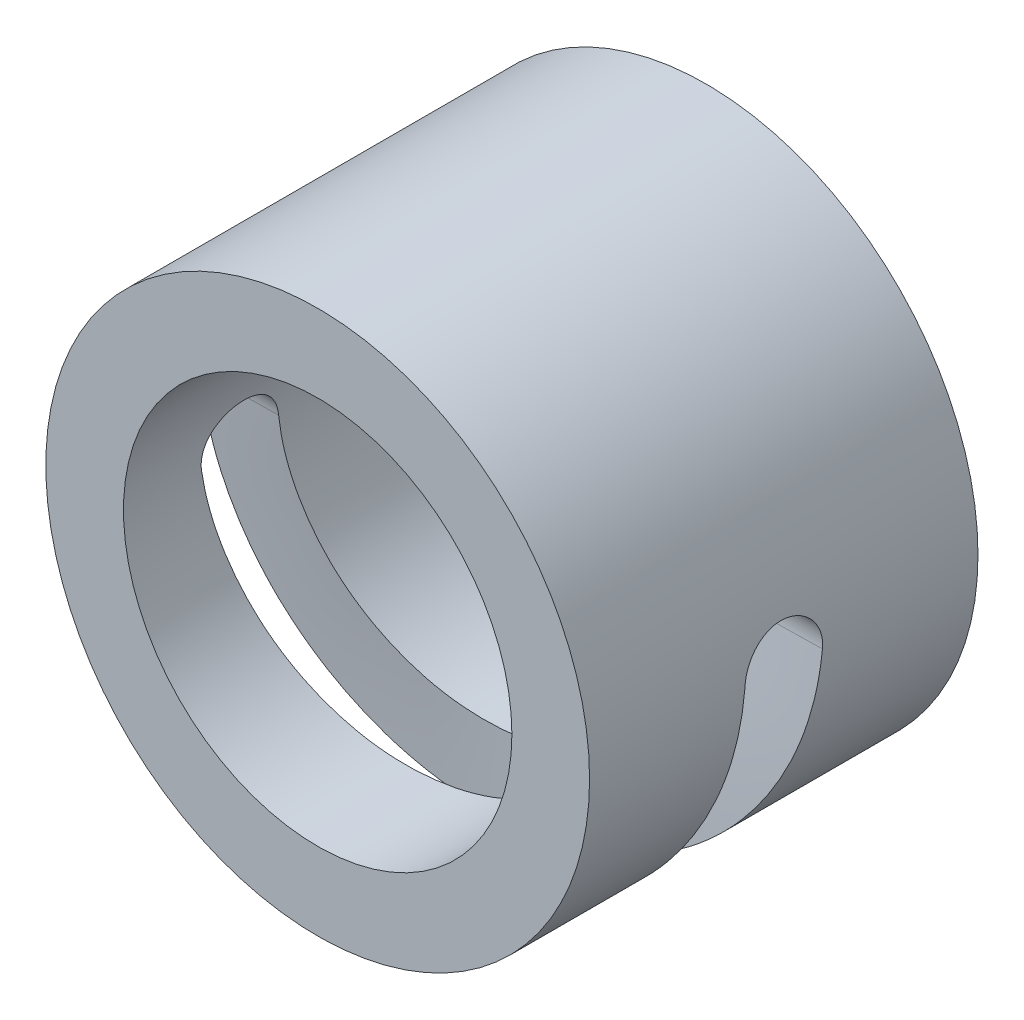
ISO-10303-21;
HEADER;
FILE_DESCRIPTION(('STEP AP214'),'2;1');
FILE_NAME('part.step','',(''),(''),'','','');
FILE_SCHEMA(('AUTOMOTIVE_DESIGN { 1 0 10303 214 1 1 1 1 }'));
ENDSEC;
DATA;
#1=APPLICATION_CONTEXT('core data for automotive mechanical design processes');
#2=APPLICATION_PROTOCOL_DEFINITION('international standard','automotive_design',2000,#1);
#3=PRODUCT_CONTEXT('',#1,'mechanical');
#4=PRODUCT('Part','Part','',(#3));
#5=PRODUCT_RELATED_PRODUCT_CATEGORY('part','',(#4));
#6=PRODUCT_DEFINITION_FORMATION('','',#4);
#7=PRODUCT_DEFINITION_CONTEXT('part definition',#1,'design');
#8=PRODUCT_DEFINITION('design','',#6,#7);
#9=PRODUCT_DEFINITION_SHAPE('','',#8);
#10=(LENGTH_UNIT() NAMED_UNIT(*) SI_UNIT(.MILLI.,.METRE.));
#11=(NAMED_UNIT(*) PLANE_ANGLE_UNIT() SI_UNIT($,.RADIAN.));
#12=(NAMED_UNIT(*) SI_UNIT($,.STERADIAN.) SOLID_ANGLE_UNIT());
#13=UNCERTAINTY_MEASURE_WITH_UNIT(LENGTH_MEASURE(1.E-05),#10,'distance_accuracy_value','');
#14=(GEOMETRIC_REPRESENTATION_CONTEXT(3) GLOBAL_UNCERTAINTY_ASSIGNED_CONTEXT((#13)) GLOBAL_UNIT_ASSIGNED_CONTEXT((#10,
#11,#12)) REPRESENTATION_CONTEXT('',''));
#15=CARTESIAN_POINT('',(0.,0.,0.));
#16=DIRECTION('',(0.,0.,1.));
#17=DIRECTION('',(1.,0.,0.));
#18=AXIS2_PLACEMENT_3D('',#15,#16,#17);
#19=CARTESIAN_POINT('',(0.,0.,50.));
#20=DIRECTION('',(0.,0.,-1.));
#21=DIRECTION('',(-1.,0.,0.));
#22=AXIS2_PLACEMENT_3D('',#19,#20,#21);
#23=CYLINDRICAL_SURFACE('',#22,70.);
#24=CARTESIAN_POINT('',(0.,0.,-50.));
#25=DIRECTION('',(0.,0.,1.));
#26=DIRECTION('',(1.,0.,0.));
#27=AXIS2_PLACEMENT_3D('',#24,#25,#26);
#28=CIRCLE('',#27,70.);
#29=CARTESIAN_POINT('',(70.,0.,-50.));
#30=VERTEX_POINT('',#29);
#31=EDGE_CURVE('E181',#30,#30,#28,.T.);
#32=ORIENTED_EDGE('',*,*,#31,.T.);
#33=EDGE_LOOP('',(#32));
#34=FACE_BOUND('',#33,.T.);
#35=CARTESIAN_POINT('',(0.,0.,50.));
#36=DIRECTION('',(0.,0.,1.));
#37=DIRECTION('',(1.,0.,0.));
#38=AXIS2_PLACEMENT_3D('',#35,#36,#37);
#39=CIRCLE('',#38,70.);
#40=CARTESIAN_POINT('',(70.,0.,50.));
#41=VERTEX_POINT('',#40);
#42=EDGE_CURVE('E183',#41,#41,#39,.T.);
#43=ORIENTED_EDGE('',*,*,#42,.F.);
#44=EDGE_LOOP('',(#43));
#45=FACE_BOUND('',#44,.T.);
#46=CARTESIAN_POINT('',(-69.9947983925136,0.853345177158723,10.036425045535));
#47=CARTESIAN_POINT('',(-69.9946719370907,0.863718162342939,10.0373134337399));
#48=CARTESIAN_POINT('',(-69.9945431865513,0.874089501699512,10.0382180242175));
#49=CARTESIAN_POINT('',(-69.9916487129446,1.10314258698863,10.0585568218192));
#50=CARTESIAN_POINT('',(-69.9878658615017,1.32124380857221,10.085186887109));
#51=CARTESIAN_POINT('',(-69.9783250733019,1.75534445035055,10.1527610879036));
#52=CARTESIAN_POINT('',(-69.9725652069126,1.97134160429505,10.1937192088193));
#53=CARTESIAN_POINT('',(-69.9573912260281,2.45703305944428,10.3025125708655));
#54=CARTESIAN_POINT('',(-69.947413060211,2.7257722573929,10.3745953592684));
#55=CARTESIAN_POINT('',(-69.9247238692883,3.2563102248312,10.5408877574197));
#56=CARTESIAN_POINT('',(-69.9120115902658,3.51810574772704,10.635107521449));
#57=CARTESIAN_POINT('',(-69.8841894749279,4.03319666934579,10.8451212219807));
#58=CARTESIAN_POINT('',(-69.8690763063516,4.28647965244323,10.960945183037));
#59=CARTESIAN_POINT('',(-69.8368833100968,4.78241485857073,11.213251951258));
#60=CARTESIAN_POINT('',(-69.8198034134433,5.02506670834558,11.3497354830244));
#61=CARTESIAN_POINT('',(-69.7840422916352,5.49948869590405,11.6432709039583));
#62=CARTESIAN_POINT('',(-69.7653520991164,5.73118506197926,11.8004409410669));
#63=CARTESIAN_POINT('',(-69.7269799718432,6.18054417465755,12.1336074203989));
#64=CARTESIAN_POINT('',(-69.7072980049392,6.39820646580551,12.3096044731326));
#65=CARTESIAN_POINT('',(-69.6674980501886,6.81792854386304,12.6791373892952));
#66=CARTESIAN_POINT('',(-69.6473802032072,7.01999327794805,12.8726676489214));
#67=CARTESIAN_POINT('',(-69.6072641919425,7.40720376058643,13.2759757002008));
#68=CARTESIAN_POINT('',(-69.5872660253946,7.59234983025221,13.4857531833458));
#69=CARTESIAN_POINT('',(-69.5477975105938,7.94579989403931,13.9217886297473));
#70=CARTESIAN_POINT('',(-69.528332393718,8.11396366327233,14.1481607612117));
#71=CARTESIAN_POINT('',(-69.49064709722,8.43062280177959,14.6143682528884));
#72=CARTESIAN_POINT('',(-69.4724269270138,8.57911802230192,14.8542037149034));
#73=CARTESIAN_POINT('',(-69.4377540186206,8.85537738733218,15.3456705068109));
#74=CARTESIAN_POINT('',(-69.4213013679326,8.98314050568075,15.5973024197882));
#75=CARTESIAN_POINT('',(-69.3906404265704,9.2169917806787,16.1105760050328));
#76=CARTESIAN_POINT('',(-69.3764321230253,9.32308006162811,16.3722176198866));
#77=CARTESIAN_POINT('',(-69.3507162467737,9.51247953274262,16.902770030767));
#78=CARTESIAN_POINT('',(-69.3391998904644,9.59586495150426,17.171653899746));
#79=CARTESIAN_POINT('',(-69.3191431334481,9.73969580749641,17.715598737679));
#80=CARTESIAN_POINT('',(-69.310602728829,9.80014127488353,17.9906596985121));
#81=CARTESIAN_POINT('',(-69.2967485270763,9.89762960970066,18.5449619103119));
#82=CARTESIAN_POINT('',(-69.2914345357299,9.93467388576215,18.8242029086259));
#83=CARTESIAN_POINT('',(-69.2841887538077,9.98508087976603,19.3848572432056));
#84=CARTESIAN_POINT('',(-69.2822569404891,9.99844375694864,19.6662705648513));
#85=CARTESIAN_POINT('',(-69.2818342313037,10.001372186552,20.2266583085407));
#86=CARTESIAN_POINT('',(-69.2833121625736,9.99115332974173,20.5056316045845));
#87=CARTESIAN_POINT('',(-69.2896017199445,9.94744085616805,21.0617092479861));
#88=CARTESIAN_POINT('',(-69.2944133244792,9.9139473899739,21.338813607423));
#89=CARTESIAN_POINT('',(-69.3072311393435,9.8239388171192,21.8891801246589));
#90=CARTESIAN_POINT('',(-69.3152373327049,9.76742383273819,22.162442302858));
#91=CARTESIAN_POINT('',(-69.3342138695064,9.63179474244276,22.703193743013));
#92=CARTESIAN_POINT('',(-69.345184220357,9.55268058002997,22.9706829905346));
#93=CARTESIAN_POINT('',(-69.3697672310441,9.37249428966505,23.4978447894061));
#94=CARTESIAN_POINT('',(-69.3833782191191,9.2714360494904,23.7575221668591));
#95=CARTESIAN_POINT('',(-69.4128602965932,9.04806650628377,24.2674340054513));
#96=CARTESIAN_POINT('',(-69.428731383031,8.92575523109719,24.517668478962));
#97=CARTESIAN_POINT('',(-69.4622826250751,8.66078019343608,25.0069242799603));
#98=CARTESIAN_POINT('',(-69.4799624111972,8.51812058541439,25.2459478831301));
#99=CARTESIAN_POINT('',(-69.5166469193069,8.21336454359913,25.7113100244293));
#100=CARTESIAN_POINT('',(-69.5356522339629,8.05125939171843,25.9376428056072));
#101=CARTESIAN_POINT('',(-69.5746208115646,7.707291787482,26.3778826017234));
#102=CARTESIAN_POINT('',(-69.5945909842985,7.52526933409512,26.5916640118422));
#103=CARTESIAN_POINT('',(-69.6347620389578,7.1439929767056,27.0030716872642));
#104=CARTESIAN_POINT('',(-69.6549628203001,6.94474635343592,27.2007047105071));
#105=CARTESIAN_POINT('',(-69.6950451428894,6.53024087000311,27.5786327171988));
#106=CARTESIAN_POINT('',(-69.7149265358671,6.31497482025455,27.7589198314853));
#107=CARTESIAN_POINT('',(-69.7538024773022,5.87000065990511,28.1007922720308));
#108=CARTESIAN_POINT('',(-69.7727970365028,5.64029272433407,28.2623778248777));
#109=CARTESIAN_POINT('',(-69.8094579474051,5.16683894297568,28.5664665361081));
#110=CARTESIAN_POINT('',(-69.8271171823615,4.92302864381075,28.7088702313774));
#111=CARTESIAN_POINT('',(-69.8604999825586,4.42414262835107,28.9726026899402));
#112=CARTESIAN_POINT('',(-69.8762235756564,4.16906707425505,29.0939317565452));
#113=CARTESIAN_POINT('',(-69.9052741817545,3.64968507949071,29.3145231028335));
#114=CARTESIAN_POINT('',(-69.9186034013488,3.38538740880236,29.4138057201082));
#115=CARTESIAN_POINT('',(-69.9425006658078,2.84931940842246,29.5896814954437));
#116=CARTESIAN_POINT('',(-69.9530693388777,2.57755079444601,29.6662798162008));
#117=CARTESIAN_POINT('',(-69.9745057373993,1.92622887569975,29.8204083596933));
#118=CARTESIAN_POINT('',(-69.9840242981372,1.54416160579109,29.8877010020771));
#119=CARTESIAN_POINT('',(-69.9967704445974,0.774696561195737,29.977519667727));
#120=CARTESIAN_POINT('',(-69.9999980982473,0.387298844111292,30.0000461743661));
#121=CARTESIAN_POINT('',(-70.0000013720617,-0.279425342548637,30.0000548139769));
#122=CARTESIAN_POINT('',(-69.9983236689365,-0.558799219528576,29.988335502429));
#123=CARTESIAN_POINT('',(-69.9916626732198,-1.11563319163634,29.9415508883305));
#124=CARTESIAN_POINT('',(-69.986678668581,-1.39309286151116,29.9064805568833));
#125=CARTESIAN_POINT('',(-69.9735373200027,-1.9442624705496,29.8132089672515));
#126=CARTESIAN_POINT('',(-69.965377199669,-2.21796891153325,29.7549874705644));
#127=CARTESIAN_POINT('',(-69.9461137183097,-2.75945101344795,29.6158510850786));
#128=CARTESIAN_POINT('',(-69.9350103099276,-3.02722657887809,29.5349358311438));
#129=CARTESIAN_POINT('',(-69.9101810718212,-3.55475241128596,29.3510814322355));
#130=CARTESIAN_POINT('',(-69.8964572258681,-3.81450857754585,29.2481589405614));
#131=CARTESIAN_POINT('',(-69.8667646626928,-4.32439843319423,29.02100327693));
#132=CARTESIAN_POINT('',(-69.8507959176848,-4.57453200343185,28.896769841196));
#133=CARTESIAN_POINT('',(-69.8170635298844,-5.06336389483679,28.6279286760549));
#134=CARTESIAN_POINT('',(-69.7993004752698,-5.30206592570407,28.4833276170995));
#135=CARTESIAN_POINT('',(-69.7624618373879,-5.76656091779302,28.1746913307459));
#136=CARTESIAN_POINT('',(-69.7433858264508,-5.99234962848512,28.0106497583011));
#137=CARTESIAN_POINT('',(-69.704334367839,-6.43074719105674,27.6632382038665));
#138=CARTESIAN_POINT('',(-69.6843540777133,-6.64326566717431,27.4797547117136));
#139=CARTESIAN_POINT('',(-69.6441658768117,-7.05211776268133,27.0955863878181));
#140=CARTESIAN_POINT('',(-69.6239579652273,-7.24845132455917,26.894901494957));
#141=CARTESIAN_POINT('',(-69.5838781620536,-7.62361514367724,26.4776724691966));
#142=CARTESIAN_POINT('',(-69.5640063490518,-7.8024413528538,26.2611246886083));
#143=CARTESIAN_POINT('',(-69.525171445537,-8.14122887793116,25.8137862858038));
#144=CARTESIAN_POINT('',(-69.5062080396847,-8.30119676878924,25.5830006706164));
#145=CARTESIAN_POINT('',(-69.4696356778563,-8.60190541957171,25.1076136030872));
#146=CARTESIAN_POINT('',(-69.4520334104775,-8.74255358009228,24.8629530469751));
#147=CARTESIAN_POINT('',(-69.4187884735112,-9.00272267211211,24.3625152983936));
#148=CARTESIAN_POINT('',(-69.4031458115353,-9.12224352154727,24.1067380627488));
#149=CARTESIAN_POINT('',(-69.3742745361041,-9.33927326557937,23.5858878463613));
#150=CARTESIAN_POINT('',(-69.3610458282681,-9.43678302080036,23.3208152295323));
#151=CARTESIAN_POINT('',(-69.3373883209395,-9.60906599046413,22.7832597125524));
#152=CARTESIAN_POINT('',(-69.326959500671,-9.68383937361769,22.510776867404));
#153=CARTESIAN_POINT('',(-69.3092687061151,-9.80965258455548,21.962238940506));
#154=CARTESIAN_POINT('',(-69.3019856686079,-9.86085042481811,21.6862207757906));
#155=CARTESIAN_POINT('',(-69.2906961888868,-9.93987015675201,21.1307918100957));
#156=CARTESIAN_POINT('',(-69.28668973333,-9.96769214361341,20.8513810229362));
#157=CARTESIAN_POINT('',(-69.2820707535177,-9.99974677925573,20.2911942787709));
#158=CARTESIAN_POINT('',(-69.2814580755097,-10.0039804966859,20.0104183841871));
#159=CARTESIAN_POINT('',(-69.2836442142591,-9.98882889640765,19.4495186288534));
#160=CARTESIAN_POINT('',(-69.2864430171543,-9.9694436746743,19.1693947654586));
#161=CARTESIAN_POINT('',(-69.2953364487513,-9.90743737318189,18.6139185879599));
#162=CARTESIAN_POINT('',(-69.3014061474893,-9.86499203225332,18.3385462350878));
#163=CARTESIAN_POINT('',(-69.3166503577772,-9.75730168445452,17.792386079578));
#164=CARTESIAN_POINT('',(-69.3258248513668,-9.69205680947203,17.5215982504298));
#165=CARTESIAN_POINT('',(-69.3470162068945,-9.53924978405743,16.9865038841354));
#166=CARTESIAN_POINT('',(-69.3590331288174,-9.45168716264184,16.7221974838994));
#167=CARTESIAN_POINT('',(-69.3855672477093,-9.25488564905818,16.2019118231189));
#168=CARTESIAN_POINT('',(-69.4000844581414,-9.14564664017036,15.9459326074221));
#169=CARTESIAN_POINT('',(-69.4312619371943,-8.90587014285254,15.4432115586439));
#170=CARTESIAN_POINT('',(-69.4479293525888,-8.77526121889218,15.1965042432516));
#171=CARTESIAN_POINT('',(-69.4829034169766,-8.4938935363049,14.7148690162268));
#172=CARTESIAN_POINT('',(-69.5012106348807,-8.34312777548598,14.4799452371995));
#173=CARTESIAN_POINT('',(-69.5389421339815,-8.02256555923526,14.0236128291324));
#174=CARTESIAN_POINT('',(-69.558366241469,-7.85277205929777,13.8022021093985));
#175=CARTESIAN_POINT('',(-69.597791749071,-7.49531229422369,13.3743661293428));
#176=CARTESIAN_POINT('',(-69.6177931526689,-7.30764592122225,13.1679409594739));
#177=CARTESIAN_POINT('',(-69.6580004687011,-6.91393325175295,12.7696699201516));
#178=CARTESIAN_POINT('',(-69.6782065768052,-6.70773439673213,12.5779748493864));
#179=CARTESIAN_POINT('',(-69.7180632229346,-6.27995076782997,12.2126816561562));
#180=CARTESIAN_POINT('',(-69.7377139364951,-6.05837093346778,12.0390777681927));
#181=CARTESIAN_POINT('',(-69.7759195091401,-5.60122094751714,11.7110603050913));
#182=CARTESIAN_POINT('',(-69.7944739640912,-5.36564569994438,11.5566537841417));
#183=CARTESIAN_POINT('',(-69.8299548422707,-4.88222629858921,11.2682125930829));
#184=CARTESIAN_POINT('',(-69.846881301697,-4.63438241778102,11.1341774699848));
#185=CARTESIAN_POINT('',(-69.8786416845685,-4.12793612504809,10.8873390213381));
#186=CARTESIAN_POINT('',(-69.893473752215,-3.86932443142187,10.7745544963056));
#187=CARTESIAN_POINT('',(-69.9206056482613,-3.343386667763,10.5711994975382));
#188=CARTESIAN_POINT('',(-69.9329055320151,-3.07606078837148,10.480628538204));
#189=CARTESIAN_POINT('',(-69.9546144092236,-2.53480054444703,10.3224360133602));
#190=CARTESIAN_POINT('',(-69.9640255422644,-2.26087123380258,10.254797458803));
#191=CARTESIAN_POINT('',(-69.9796980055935,-1.70828983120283,10.1429104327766));
#192=CARTESIAN_POINT('',(-69.9859603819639,-1.42963933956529,10.0986541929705));
#193=CARTESIAN_POINT('',(-69.9960190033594,-0.817172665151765,10.0277778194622));
#194=CARTESIAN_POINT('',(-69.999135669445,-0.48277874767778,10.0059991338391));
#195=CARTESIAN_POINT('',(-70.0005499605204,0.1860904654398,9.99609917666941));
#196=CARTESIAN_POINT('',(-69.9988552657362,0.520564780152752,10.0079242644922));
#197=CARTESIAN_POINT('',(-69.9947983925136,0.853345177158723,10.036425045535));
#198=B_SPLINE_CURVE_WITH_KNOTS('',3,(#46,#47,#48,#49,#50,#51,#52,#53,#54,#55,#56,#57,#58,#59,
#60,#61,#62,#63,#64,#65,#66,#67,#68,#69,#70,#71,#72,#73,#74,#75,#76,#77,#78,#79,#80,#81,#82,#83,
#84,#85,#86,#87,#88,#89,#90,#91,#92,#93,#94,#95,#96,#97,#98,#99,#100,#101,#102,#103,#104,#105,
#106,#107,#108,#109,#110,#111,#112,#113,#114,#115,#116,#117,#118,#119,#120,#121,#122,#123,#124,
#125,#126,#127,#128,#129,#130,#131,#132,#133,#134,#135,#136,#137,#138,#139,#140,#141,#142,#143,
#144,#145,#146,#147,#148,#149,#150,#151,#152,#153,#154,#155,#156,#157,#158,#159,#160,#161,#162,
#163,#164,#165,#166,#167,#168,#169,#170,#171,#172,#173,#174,#175,#176,#177,#178,#179,#180,#181,
#182,#183,#184,#185,#186,#187,#188,#189,#190,#191,#192,#193,#194,#195,#196,#197),.UNSPECIFIED.,
.T.,.F.,(4,2,2,2,2,2,2,2,2,2,2,2,2,2,2,2,2,2,2,2,2,2,2,2,2,2,2,2,2,2,2,2,2,2,2,2,2,2,2,2,2,2,2,
2,2,2,2,2,2,2,2,2,2,2,2,2,2,2,2,2,2,2,2,2,2,2,2,2,2,2,2,2,2,2,2,4),(0.,0.0312348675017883,
0.689915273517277,1.34924041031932,2.18346494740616,3.01807289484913,3.85384950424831,
4.68965543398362,5.53046080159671,6.37129344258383,7.21185828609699,8.05240717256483,
8.8994096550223,9.74641854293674,10.5934693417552,11.4405152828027,12.2847575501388,
13.128998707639,13.9731890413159,14.8173736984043,15.6538711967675,16.490363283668,
17.326850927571,18.1633406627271,18.9993025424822,19.8352633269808,20.6710536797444,
21.5072201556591,22.3506801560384,23.1937853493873,24.0372712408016,24.880746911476,
25.7284404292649,26.5761217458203,27.4230178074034,28.2697209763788,29.4311599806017,
30.5925864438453,31.4305233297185,32.2686407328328,33.1074924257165,33.9463576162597,
34.7845902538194,35.6228332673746,36.4608023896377,37.2990457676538,38.1424852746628,
38.985927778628,39.8295648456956,40.6729069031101,41.5201596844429,42.3674157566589,
43.2146386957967,44.0618553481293,44.9033078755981,45.7447569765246,46.5861679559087,
47.4275755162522,48.2626589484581,49.0977375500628,49.9328337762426,50.7679344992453,
51.6058860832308,52.4441295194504,53.2822429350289,54.1203614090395,54.966153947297,
55.8116761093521,56.6575080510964,57.5033211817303,58.3498791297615,59.1964185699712,
60.0423294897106,60.8879591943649,61.8916202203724,62.8936800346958),.UNSPECIFIED.);
#199=CARTESIAN_POINT('',(-69.9947983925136,0.853345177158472,10.036425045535));
#200=VERTEX_POINT('',#199);
#201=CARTESIAN_POINT('',(-69.9939921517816,-0.917094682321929,29.9579094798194));
#202=VERTEX_POINT('',#201);
#203=EDGE_CURVE('E56',#200,#202,#198,.T.);
#204=ORIENTED_EDGE('',*,*,#203,.T.);
#205=CARTESIAN_POINT('',(-69.9944032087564,-0.885166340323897,29.9607469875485));
#206=CARTESIAN_POINT('',(-69.9819162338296,-1.87360496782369,29.8729093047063));
#207=CARTESIAN_POINT('',(-69.9484665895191,-2.86173321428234,29.7845780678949));
#208=CARTESIAN_POINT('',(-69.8397715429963,-4.83557020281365,29.6070897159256));
#209=CARTESIAN_POINT('',(-69.7645279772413,-5.82127904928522,29.5179326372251));
#210=CARTESIAN_POINT('',(-69.5723759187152,-7.7885414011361,29.3389482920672));
#211=CARTESIAN_POINT('',(-69.4554684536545,-8.77009500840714,29.249121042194));
#212=CARTESIAN_POINT('',(-69.1802081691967,-10.7273193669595,29.0689538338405));
#213=CARTESIAN_POINT('',(-69.0218556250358,-11.7029901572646,28.9786138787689));
#214=CARTESIAN_POINT('',(-68.6641167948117,-13.6460334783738,28.7976446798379));
#215=CARTESIAN_POINT('',(-68.4647596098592,-14.6134113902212,28.7070156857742));
#216=CARTESIAN_POINT('',(-68.0253029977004,-16.5388406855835,28.5255662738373));
#217=CARTESIAN_POINT('',(-67.7852038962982,-17.4968921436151,28.4347458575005));
#218=CARTESIAN_POINT('',(-67.2646888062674,-19.4019761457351,28.2530738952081));
#219=CARTESIAN_POINT('',(-66.9842730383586,-20.3490087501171,28.1622223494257));
#220=CARTESIAN_POINT('',(-66.3836312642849,-22.2303536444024,27.9806514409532));
#221=CARTESIAN_POINT('',(-66.0634053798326,-23.1646659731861,27.88993207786));
#222=CARTESIAN_POINT('',(-65.2701532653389,-25.3286848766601,27.6785246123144));
#223=CARTESIAN_POINT('',(-64.7818158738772,-26.5528194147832,27.557947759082));
#224=CARTESIAN_POINT('',(-63.7367716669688,-28.9717036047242,27.3176897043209));
#225=CARTESIAN_POINT('',(-63.1800640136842,-30.1664528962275,27.1980085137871));
#226=CARTESIAN_POINT('',(-62.295136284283,-31.9335277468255,27.0194659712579));
#227=CARTESIAN_POINT('',(-61.9918332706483,-32.5184058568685,26.9601121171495));
#228=CARTESIAN_POINT('',(-61.3688072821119,-33.6794216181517,26.8417641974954));
#229=CARTESIAN_POINT('',(-61.0490842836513,-34.2555592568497,26.782770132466));
#230=CARTESIAN_POINT('',(-60.557425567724,-35.1127712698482,26.6946143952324));
#231=CARTESIAN_POINT('',(-60.3915419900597,-35.3973182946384,26.6652875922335));
#232=CARTESIAN_POINT('',(-60.1397139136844,-35.8223663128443,26.621357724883));
#233=CARTESIAN_POINT('',(-60.0552707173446,-35.9637536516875,26.6067244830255));
#234=CARTESIAN_POINT('',(-59.8853901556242,-36.2459262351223,26.5774205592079));
#235=CARTESIAN_POINT('',(-59.7999527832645,-36.3867114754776,26.5627498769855));
#236=CARTESIAN_POINT('',(-59.3702970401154,-37.0891048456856,26.4893354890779));
#237=CARTESIAN_POINT('',(-59.0186373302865,-37.6461724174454,26.4304028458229));
#238=CARTESIAN_POINT('',(-58.2997618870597,-38.7501181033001,26.3121630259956));
#239=CARTESIAN_POINT('',(-57.932546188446,-39.2969962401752,26.2528558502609));
#240=CARTESIAN_POINT('',(-57.1828416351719,-40.3801490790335,26.1339183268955));
#241=CARTESIAN_POINT('',(-56.8003527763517,-40.9164237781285,26.0742879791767));
#242=CARTESIAN_POINT('',(-56.0204056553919,-41.9779455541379,25.9547492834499));
#243=CARTESIAN_POINT('',(-55.6229474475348,-42.5031926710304,25.8948409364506));
#244=CARTESIAN_POINT('',(-54.8133928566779,-43.542229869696,25.7747958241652));
#245=CARTESIAN_POINT('',(-54.4012964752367,-44.056019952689,25.7146590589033));
#246=CARTESIAN_POINT('',(-53.1434944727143,-45.5796381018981,25.5339712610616));
#247=CARTESIAN_POINT('',(-52.2762274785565,-46.5717800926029,25.4131352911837));
#248=CARTESIAN_POINT('',(-50.4871705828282,-48.5054728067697,25.171118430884));
#249=CARTESIAN_POINT('',(-49.5653804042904,-49.4470232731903,25.049937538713));
#250=CARTESIAN_POINT('',(-47.6701271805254,-51.2766386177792,24.8076040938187));
#251=CARTESIAN_POINT('',(-46.6966641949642,-52.1647035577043,24.6864515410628));
#252=CARTESIAN_POINT('',(-44.7010200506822,-53.8846402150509,24.4445436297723));
#253=CARTESIAN_POINT('',(-43.6788312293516,-54.7165030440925,24.3237883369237));
#254=CARTESIAN_POINT('',(-41.5890082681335,-56.3213082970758,24.0830675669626));
#255=CARTESIAN_POINT('',(-40.5213740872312,-57.0942506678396,23.963102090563));
#256=CARTESIAN_POINT('',(-38.888560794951,-58.2075084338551,23.7840518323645));
#257=CARTESIAN_POINT('',(-38.3390357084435,-58.570917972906,23.7245152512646));
#258=CARTESIAN_POINT('',(-37.2298941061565,-59.2821127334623,23.6057836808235));
#259=CARTESIAN_POINT('',(-36.6702775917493,-59.6298979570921,23.5465886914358));
#260=CARTESIAN_POINT('',(-35.8236527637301,-60.1396245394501,23.4580837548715));
#261=CARTESIAN_POINT('',(-35.5402393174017,-60.3075444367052,23.4286295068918));
#262=CARTESIAN_POINT('',(-34.9710591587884,-60.6393727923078,23.369835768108));
#263=CARTESIAN_POINT('',(-34.6852924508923,-60.803281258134,23.3404962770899));
#264=CARTESIAN_POINT('',(-34.1114690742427,-61.127049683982,23.2818816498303));
#265=CARTESIAN_POINT('',(-33.8234124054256,-61.2869096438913,23.2526065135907));
#266=CARTESIAN_POINT('',(-33.2450815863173,-61.6025411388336,23.1939111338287));
#267=CARTESIAN_POINT('',(-32.9548074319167,-61.7583126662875,23.1644908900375));
#268=CARTESIAN_POINT('',(-32.3720945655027,-62.0657394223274,23.1055618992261));
#269=CARTESIAN_POINT('',(-32.0796558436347,-62.2173946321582,23.0760531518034));
#270=CARTESIAN_POINT('',(-31.4926765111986,-62.5165564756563,23.0169397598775));
#271=CARTESIAN_POINT('',(-31.1981359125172,-62.6640631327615,22.9873351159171));
#272=CARTESIAN_POINT('',(-30.3114550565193,-63.1003147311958,22.8983916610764));
#273=CARTESIAN_POINT('',(-29.7162430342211,-63.3827980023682,22.8389220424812));
#274=CARTESIAN_POINT('',(-27.9190619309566,-64.2048390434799,22.6600602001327));
#275=CARTESIAN_POINT('',(-26.7054294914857,-64.7190504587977,22.5402030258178));
#276=CARTESIAN_POINT('',(-24.2513106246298,-65.6780761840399,22.2996681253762));
#277=CARTESIAN_POINT('',(-23.0108261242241,-66.1228954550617,22.1789904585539));
#278=CARTESIAN_POINT('',(-20.5067461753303,-66.9418290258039,21.9371760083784));
#279=CARTESIAN_POINT('',(-19.243150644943,-67.3159430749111,21.8160392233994));
#280=CARTESIAN_POINT('',(-16.6968983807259,-67.992271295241,21.5736942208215));
#281=CARTESIAN_POINT('',(-15.4142416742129,-68.2944855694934,21.4524860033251));
#282=CARTESIAN_POINT('',(-12.8338406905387,-68.8260666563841,21.2103741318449));
#283=CARTESIAN_POINT('',(-11.5360967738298,-69.055435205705,21.0894704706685));
#284=CARTESIAN_POINT('',(-9.58143700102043,-69.3442867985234,20.9086487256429));
#285=CARTESIAN_POINT('',(-8.92851031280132,-69.4313734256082,20.8484607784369));
#286=CARTESIAN_POINT('',(-7.62041916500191,-69.587089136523,20.7283039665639));
#287=CARTESIAN_POINT('',(-6.96525470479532,-69.6557182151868,20.6683351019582));
#288=CARTESIAN_POINT('',(-5.65323216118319,-69.7744571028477,20.5486662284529));
#289=CARTESIAN_POINT('',(-4.99637408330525,-69.8245669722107,20.4889662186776));
#290=CARTESIAN_POINT('',(-3.68147829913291,-69.9062273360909,20.3698836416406));
#291=CARTESIAN_POINT('',(-3.02344059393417,-69.9377778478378,20.3105010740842));
#292=CARTESIAN_POINT('',(-1.70667834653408,-69.982292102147,20.1920925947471));
#293=CARTESIAN_POINT('',(-1.04795378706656,-69.9952553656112,20.1330666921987));
#294=CARTESIAN_POINT('',(-0.0597783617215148,-70.0007495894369,20.0448499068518));
#295=CARTESIAN_POINT('',(0.269632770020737,-70.0002557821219,20.0154975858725));
#296=CARTESIAN_POINT('',(0.928422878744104,-69.9946179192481,19.9568786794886));
#297=CARTESIAN_POINT('',(1.25780185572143,-69.9894738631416,19.927612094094));
#298=CARTESIAN_POINT('',(2.2457647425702,-69.9670676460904,19.8396151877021));
#299=CARTESIAN_POINT('',(2.90418645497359,-69.9428315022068,19.7806866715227));
#300=CARTESIAN_POINT('',(4.22003458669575,-69.8757848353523,19.6624835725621));
#301=CARTESIAN_POINT('',(4.8774610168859,-69.8329745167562,19.6032089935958));
#302=CARTESIAN_POINT('',(6.19080667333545,-69.728816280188,19.4843241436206));
#303=CARTESIAN_POINT('',(6.8467259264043,-69.6674686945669,19.424713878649));
#304=CARTESIAN_POINT('',(8.15656276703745,-69.5262859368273,19.3052118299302));
#305=CARTESIAN_POINT('',(8.81048027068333,-69.4464500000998,19.2453200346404));
#306=CARTESIAN_POINT('',(10.4420430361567,-69.2238376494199,19.0953019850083));
#307=CARTESIAN_POINT('',(11.4181275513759,-69.0695471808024,19.0050265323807));
#308=CARTESIAN_POINT('',(13.3628970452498,-68.7197877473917,18.8241034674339));
#309=CARTESIAN_POINT('',(14.3315815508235,-68.5243161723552,18.7334558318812));
#310=CARTESIAN_POINT('',(16.2597663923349,-68.0925547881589,18.5519546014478));
#311=CARTESIAN_POINT('',(17.2192670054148,-67.856266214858,18.4611010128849));
#312=CARTESIAN_POINT('',(19.1274024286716,-67.3432885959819,18.2793470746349));
#313=CARTESIAN_POINT('',(20.0760372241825,-67.0665994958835,18.1884467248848));
#314=CARTESIAN_POINT('',(21.9607460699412,-66.4733153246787,18.0067617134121));
#315=CARTESIAN_POINT('',(22.8968202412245,-66.1567206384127,17.9159770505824));
#316=CARTESIAN_POINT('',(24.754772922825,-65.4841760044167,17.7346822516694));
#317=CARTESIAN_POINT('',(25.6766511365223,-65.1282252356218,17.644172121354));
#318=CARTESIAN_POINT('',(27.5045637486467,-64.3775985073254,17.4635886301));
#319=CARTESIAN_POINT('',(28.4105978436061,-63.9829218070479,17.373515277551));
#320=CARTESIAN_POINT('',(30.205153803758,-63.1555604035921,17.1939718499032));
#321=CARTESIAN_POINT('',(31.0936767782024,-62.7228781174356,17.1045017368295));
#322=CARTESIAN_POINT('',(32.558743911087,-61.9706568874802,16.9560103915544));
#323=CARTESIAN_POINT('',(33.1405953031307,-61.6614548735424,16.8967765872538));
#324=CARTESIAN_POINT('',(34.006653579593,-61.1854233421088,16.8082167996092));
#325=CARTESIAN_POINT('',(34.2942173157,-61.024709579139,16.778745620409));
#326=CARTESIAN_POINT('',(34.8670573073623,-60.6992325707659,16.7199049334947));
#327=CARTESIAN_POINT('',(35.1523335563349,-60.5344693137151,16.6905354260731));
#328=CARTESIAN_POINT('',(35.7205443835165,-60.2009238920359,16.6319047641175));
#329=CARTESIAN_POINT('',(36.0034789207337,-60.0321416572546,16.602643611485));
#330=CARTESIAN_POINT('',(36.5669260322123,-59.6906060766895,16.5439824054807));
#331=CARTESIAN_POINT('',(36.8474386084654,-59.5178527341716,16.514582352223));
#332=CARTESIAN_POINT('',(37.405993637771,-59.1684051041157,16.4556904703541));
#333=CARTESIAN_POINT('',(37.6840360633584,-58.9917107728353,16.4261986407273));
#334=CARTESIAN_POINT('',(38.2375894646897,-58.6344205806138,16.3671184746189));
#335=CARTESIAN_POINT('',(38.5131004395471,-58.4538247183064,16.3375301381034));
#336=CARTESIAN_POINT('',(39.3357523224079,-57.9062397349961,16.248633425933));
#337=CARTESIAN_POINT('',(39.879029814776,-57.533442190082,16.1891914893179));
#338=CARTESIAN_POINT('',(40.9548106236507,-56.7726829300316,16.0700006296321));
#339=CARTESIAN_POINT('',(41.4873139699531,-56.3847212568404,16.0102517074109));
#340=CARTESIAN_POINT('',(42.5411098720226,-55.5939552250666,15.8904963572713));
#341=CARTESIAN_POINT('',(43.0624031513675,-55.1911518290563,15.8304899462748));
#342=CARTESIAN_POINT('',(44.0933825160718,-54.3710178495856,15.7102654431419));
#343=CARTESIAN_POINT('',(44.6030685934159,-53.9536872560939,15.6500473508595));
#344=CARTESIAN_POINT('',(46.1141206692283,-52.6803828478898,15.4691450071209));
#345=CARTESIAN_POINT('',(47.0975814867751,-51.8030206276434,15.3482012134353));
#346=CARTESIAN_POINT('',(49.0133462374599,-49.9942758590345,15.1060379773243));
#347=CARTESIAN_POINT('',(49.9456503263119,-49.0628934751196,14.984818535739));
#348=CARTESIAN_POINT('',(51.7560400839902,-47.1491960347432,14.7425038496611));
#349=CARTESIAN_POINT('',(52.6341379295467,-46.166892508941,14.6214085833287));
#350=CARTESIAN_POINT('',(54.3335332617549,-44.1542972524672,14.3797024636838));
#351=CARTESIAN_POINT('',(55.1548305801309,-43.1240053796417,14.2590916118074));
#352=CARTESIAN_POINT('',(56.7380836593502,-41.018586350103,14.01872739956));
#353=CARTESIAN_POINT('',(57.5000391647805,-39.9434590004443,13.8989740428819));
#354=CARTESIAN_POINT('',(58.5966727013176,-38.2996644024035,13.7202682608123));
#355=CARTESIAN_POINT('',(58.9545833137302,-37.7464083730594,13.6608391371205));
#356=CARTESIAN_POINT('',(59.654659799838,-36.6299820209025,13.5423426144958));
#357=CARTESIAN_POINT('',(59.9968263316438,-36.0668121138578,13.4832752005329));
#358=CARTESIAN_POINT('',(60.4980532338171,-35.2149701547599,13.3949720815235));
#359=CARTESIAN_POINT('',(60.6631290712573,-34.9298343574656,13.3655866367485));
#360=CARTESIAN_POINT('',(60.989240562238,-34.3572565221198,13.30693859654));
#361=CARTESIAN_POINT('',(61.1502762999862,-34.0698145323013,13.2776759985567));
#362=CARTESIAN_POINT('',(61.6272652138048,-33.2041316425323,13.189705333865));
#363=CARTESIAN_POINT('',(61.937104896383,-32.6225256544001,13.1308135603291));
#364=CARTESIAN_POINT('',(62.5402091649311,-31.4508563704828,13.0126692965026));
#365=CARTESIAN_POINT('',(62.8334743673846,-30.8607933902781,12.9534168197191));
#366=CARTESIAN_POINT('',(63.4032170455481,-29.6726497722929,12.8345740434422));
#367=CARTESIAN_POINT('',(63.6796945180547,-29.0745691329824,12.7749837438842));
#368=CARTESIAN_POINT('',(64.2158084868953,-27.8704948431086,12.6554810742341));
#369=CARTESIAN_POINT('',(64.4754346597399,-27.2644966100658,12.5955685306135));
#370=CARTESIAN_POINT('',(64.9774518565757,-26.0454477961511,12.4755052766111));
#371=CARTESIAN_POINT('',(65.2198428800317,-25.4323972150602,12.4153545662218));
#372=CARTESIAN_POINT('',(65.9208929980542,-23.5833291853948,12.2346105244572));
#373=CARTESIAN_POINT('',(66.3534598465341,-22.3373264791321,12.1137184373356));
#374=CARTESIAN_POINT('',(67.147558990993,-19.8228202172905,11.8715368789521));
#375=CARTESIAN_POINT('',(67.5090814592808,-18.5543135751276,11.7502473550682));
#376=CARTESIAN_POINT('',(68.1594265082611,-16.0008011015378,11.5078434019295));
#377=CARTESIAN_POINT('',(68.4483574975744,-14.7158229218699,11.386728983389));
#378=CARTESIAN_POINT('',(68.9532616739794,-12.1318035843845,11.1448986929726));
#379=CARTESIAN_POINT('',(69.1692455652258,-10.8327645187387,11.0241827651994));
#380=CARTESIAN_POINT('',(69.5275343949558,-8.22512701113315,10.7835685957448));
#381=CARTESIAN_POINT('',(69.6698797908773,-6.91653421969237,10.6636699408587));
#382=CARTESIAN_POINT('',(69.818616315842,-5.06502948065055,10.4952226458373));
#383=CARTESIAN_POINT('',(69.855727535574,-4.52448157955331,10.4461876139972));
#384=CARTESIAN_POINT('',(69.9173864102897,-3.44273988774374,10.3483452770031));
#385=CARTESIAN_POINT('',(69.9419365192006,-2.90154624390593,10.2995379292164));
#386=CARTESIAN_POINT('',(69.9784380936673,-1.81955202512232,10.2022445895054));
#387=CARTESIAN_POINT('',(69.9904089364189,-1.2787521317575,10.1537582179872));
#388=CARTESIAN_POINT('',(70.0018139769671,-0.196891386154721,10.0570473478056));
#389=CARTESIAN_POINT('',(70.0012457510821,0.344169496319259,10.0088229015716));
#390=CARTESIAN_POINT('',(69.9944032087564,0.88516634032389,9.96074698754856));
#391=B_SPLINE_CURVE_WITH_KNOTS('',3,(#205,#206,#207,#208,#209,#210,#211,#212,#213,#214,#215,
#216,#217,#218,#219,#220,#221,#222,#223,#224,#225,#226,#227,#228,#229,#230,#231,#232,#233,#234,
#235,#236,#237,#238,#239,#240,#241,#242,#243,#244,#245,#246,#247,#248,#249,#250,#251,#252,#253,
#254,#255,#256,#257,#258,#259,#260,#261,#262,#263,#264,#265,#266,#267,#268,#269,#270,#271,#272,
#273,#274,#275,#276,#277,#278,#279,#280,#281,#282,#283,#284,#285,#286,#287,#288,#289,#290,#291,
#292,#293,#294,#295,#296,#297,#298,#299,#300,#301,#302,#303,#304,#305,#306,#307,#308,#309,#310,
#311,#312,#313,#314,#315,#316,#317,#318,#319,#320,#321,#322,#323,#324,#325,#326,#327,#328,#329,
#330,#331,#332,#333,#334,#335,#336,#337,#338,#339,#340,#341,#342,#343,#344,#345,#346,#347,#348,
#349,#350,#351,#352,#353,#354,#355,#356,#357,#358,#359,#360,#361,#362,#363,#364,#365,#366,#367,
#368,#369,#370,#371,#372,#373,#374,#375,#376,#377,#378,#379,#380,#381,#382,#383,#384,#385,#386,
#387,#388,#389,#390),.UNSPECIFIED.,.F.,.F.,(4,2,2,2,2,2,2,2,2,2,2,2,2,2,2,2,2,2,2,2,2,2,2,2,2,2,
2,2,2,2,2,2,2,2,2,2,2,2,2,2,2,2,2,2,2,2,2,2,2,2,2,2,2,2,2,2,2,2,2,2,2,2,2,2,2,2,2,2,2,2,2,2,2,2,
2,2,2,2,2,2,2,2,2,2,2,2,2,2,2,2,2,2,4),(0.,2.97701379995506,5.95389679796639,8.93070637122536,
11.9074961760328,14.8821805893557,17.8568412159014,20.8314855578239,23.8061208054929,
27.7743346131,31.7425970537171,33.7269224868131,35.7112507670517,36.7032414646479,
37.1992374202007,37.6952368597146,39.6791668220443,41.6630923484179,43.6470184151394,
45.630937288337,47.6148559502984,51.5824468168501,55.5500578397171,59.5176642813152,
63.4858967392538,67.4541327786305,69.4384402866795,71.4227475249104,72.4149368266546,
73.4071242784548,74.3993117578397,75.3915010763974,76.3836949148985,77.3758831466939,
79.3602163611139,83.3284804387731,87.296460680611,91.2644549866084,95.232443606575,
99.2003376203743,101.184482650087,103.16862823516,105.152767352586,107.136904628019,
109.121093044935,110.113214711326,111.105336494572,113.089544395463,115.073730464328,
117.057880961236,119.042113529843,122.01813326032,124.994341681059,127.970460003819,
130.946582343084,133.9226759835,136.898831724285,139.875044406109,142.851067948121,
144.835498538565,145.827696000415,146.819896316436,147.812113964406,148.804330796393,
149.796558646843,150.788786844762,152.773180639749,154.75756894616,156.741828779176,
158.726089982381,162.694232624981,166.662363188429,170.629599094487,174.596846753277,
178.564111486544,180.548724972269,182.53325542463,183.525570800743,184.517865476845,
186.502426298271,188.486913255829,190.471400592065,192.457092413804,194.442784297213,
198.413940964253,202.385646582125,206.351385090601,210.316541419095,214.27951694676,
215.911513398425,217.543190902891,219.172351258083,220.801826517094),.UNSPECIFIED.);
#392=CARTESIAN_POINT('',(69.9950785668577,0.830046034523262,9.96564577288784));
#393=VERTEX_POINT('',#392);
#394=EDGE_CURVE('E102',#202,#393,#391,.T.);
#395=ORIENTED_EDGE('',*,*,#394,.T.);
#396=CARTESIAN_POINT('',(69.9944138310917,0.884325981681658,9.96097583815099));
#397=CARTESIAN_POINT('',(69.9946423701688,0.866237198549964,9.96258174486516));
#398=CARTESIAN_POINT('',(69.994863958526,0.848143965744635,9.96413840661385));
#399=CARTESIAN_POINT('',(69.9980617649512,0.578472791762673,9.98659916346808));
#400=CARTESIAN_POINT('',(69.9996962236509,0.325991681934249,9.9980272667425));
#401=CARTESIAN_POINT('',(70.0002268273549,-0.179206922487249,10.0017412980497));
#402=CARTESIAN_POINT('',(69.9991213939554,-0.43192446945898,9.9940161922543));
#403=CARTESIAN_POINT('',(69.9941897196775,-0.936594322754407,9.9594157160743));
#404=CARTESIAN_POINT('',(69.9903574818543,-1.18854371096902,9.9324981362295));
#405=CARTESIAN_POINT('',(69.9800541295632,-1.68962816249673,9.8596319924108));
#406=CARTESIAN_POINT('',(69.9735828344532,-1.93876303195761,9.81368212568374));
#407=CARTESIAN_POINT('',(69.9573806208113,-2.45737930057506,9.69751604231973));
#408=CARTESIAN_POINT('',(69.9473892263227,-2.72641555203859,9.62533862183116));
#409=CARTESIAN_POINT('',(69.9246715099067,-3.25744820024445,9.45883447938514));
#410=CARTESIAN_POINT('',(69.9119448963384,-3.51944384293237,9.36450539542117));
#411=CARTESIAN_POINT('',(69.8841153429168,-4.03446518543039,9.15442402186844));
#412=CARTESIAN_POINT('',(69.8690132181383,-4.28749392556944,9.0386790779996));
#413=CARTESIAN_POINT('',(69.8368468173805,-4.78293449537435,8.78657313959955));
#414=CARTESIAN_POINT('',(69.8197825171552,-5.025346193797,8.65021189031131));
#415=CARTESIAN_POINT('',(69.7840417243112,-5.49949393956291,8.35684641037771));
#416=CARTESIAN_POINT('',(69.7653551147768,-5.7311467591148,8.19970888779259));
#417=CARTESIAN_POINT('',(69.7269908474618,-6.1804198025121,7.86661833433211));
#418=CARTESIAN_POINT('',(69.7073131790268,-6.39803987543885,7.6906651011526));
#419=CARTESIAN_POINT('',(69.6675130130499,-6.81777731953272,7.32114572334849));
#420=CARTESIAN_POINT('',(69.6473904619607,-7.01989281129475,7.12757744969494));
#421=CARTESIAN_POINT('',(69.6072649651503,-7.40719774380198,6.72418584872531));
#422=CARTESIAN_POINT('',(69.58726201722,-7.5923874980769,6.51436282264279));
#423=CARTESIAN_POINT('',(69.5477876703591,-7.94588622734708,6.07826765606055));
#424=CARTESIAN_POINT('',(69.5283213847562,-8.11405814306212,5.8518839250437));
#425=CARTESIAN_POINT('',(69.4906339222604,-8.43073153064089,5.38565241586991));
#426=CARTESIAN_POINT('',(69.4724127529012,-8.57923288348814,5.14580455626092));
#427=CARTESIAN_POINT('',(69.4377394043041,-8.855491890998,4.65433117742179));
#428=CARTESIAN_POINT('',(69.4212871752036,-8.98325013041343,4.40270599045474));
#429=CARTESIAN_POINT('',(69.390626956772,-9.21709313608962,3.88944652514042));
#430=CARTESIAN_POINT('',(69.3764189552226,-9.32317802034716,3.62781230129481));
#431=CARTESIAN_POINT('',(69.3507030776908,-9.51257554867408,3.09726589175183));
#432=CARTESIAN_POINT('',(69.3391865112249,-9.59596163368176,2.82838034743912));
#433=CARTESIAN_POINT('',(69.3191293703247,-9.73979376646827,2.2844321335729));
#434=CARTESIAN_POINT('',(69.3105887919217,-9.80023984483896,2.00936947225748));
#435=CARTESIAN_POINT('',(69.2967342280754,-9.89772972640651,1.45506166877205));
#436=CARTESIAN_POINT('',(69.2914200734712,-9.93477475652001,1.1758167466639));
#437=CARTESIAN_POINT('',(69.2841740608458,-9.98518283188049,0.615154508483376));
#438=CARTESIAN_POINT('',(69.2822421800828,-9.99854603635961,0.333737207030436));
#439=CARTESIAN_POINT('',(69.2818194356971,-10.0014746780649,-0.226656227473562));
#440=CARTESIAN_POINT('',(69.2832973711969,-9.99125589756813,-0.505631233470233));
#441=CARTESIAN_POINT('',(69.2895869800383,-9.9475435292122,-1.06171230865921));
#442=CARTESIAN_POINT('',(69.2943986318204,-9.91405009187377,-1.33881838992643));
#443=CARTESIAN_POINT('',(69.3072166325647,-9.82404116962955,-1.8891905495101));
#444=CARTESIAN_POINT('',(69.3152229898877,-9.76752562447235,-2.16245661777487));
#445=CARTESIAN_POINT('',(69.3341999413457,-9.63189500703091,-2.70321574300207));
#446=CARTESIAN_POINT('',(69.3451705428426,-9.55277987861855,-2.97070878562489));
#447=CARTESIAN_POINT('',(69.3697543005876,-9.37259001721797,-3.49788168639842));
#448=CARTESIAN_POINT('',(69.3833658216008,-9.27152886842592,-3.75756626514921));
#449=CARTESIAN_POINT('',(69.4128490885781,-9.04815253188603,-4.26749209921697));
#450=CARTESIAN_POINT('',(69.428720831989,-8.9258373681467,-4.5177333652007));
#451=CARTESIAN_POINT('',(69.4622728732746,-8.66085840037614,-5.00699341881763));
#452=CARTESIAN_POINT('',(69.479952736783,-8.51819948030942,-5.246014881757));
#453=CARTESIAN_POINT('',(69.5166373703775,-8.21344534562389,-5.71137302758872));
#454=CARTESIAN_POINT('',(69.5356427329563,-8.05134141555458,-5.93770395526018));
#455=CARTESIAN_POINT('',(69.5746102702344,-7.70738668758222,-6.37792768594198));
#456=CARTESIAN_POINT('',(69.5945793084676,-7.52537696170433,-6.59169572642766));
#457=CARTESIAN_POINT('',(69.6347481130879,-7.14412833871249,-7.00307910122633));
#458=CARTESIAN_POINT('',(69.6549477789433,-6.94489671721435,-7.20070118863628));
#459=CARTESIAN_POINT('',(69.6950311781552,-6.53039046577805,-7.57863992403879));
#460=CARTESIAN_POINT('',(69.7149147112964,-6.31510612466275,-7.75894594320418));
#461=CARTESIAN_POINT('',(69.7537945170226,-5.87009580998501,-8.10085046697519));
#462=CARTESIAN_POINT('',(69.7727908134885,-5.64037022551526,-8.26244947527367));
#463=CARTESIAN_POINT('',(69.8094591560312,-5.16682621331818,-8.56659671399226));
#464=CARTESIAN_POINT('',(69.8271237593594,-4.92294038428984,-8.70904092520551));
#465=CARTESIAN_POINT('',(69.8605158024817,-4.42389617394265,-8.97284061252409));
#466=CARTESIAN_POINT('',(69.8762432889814,-4.16873806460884,-9.09419659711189));
#467=CARTESIAN_POINT('',(69.9052934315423,-3.64931748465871,-9.31477664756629));
#468=CARTESIAN_POINT('',(69.9186193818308,-3.38506808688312,-9.41403107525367));
#469=CARTESIAN_POINT('',(69.942507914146,-2.84911762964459,-9.58984265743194));
#470=CARTESIAN_POINT('',(69.953071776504,-2.57742008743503,-9.66641033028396));
#471=CARTESIAN_POINT('',(69.9694872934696,-2.07875516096,-9.78442446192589));
#472=CARTESIAN_POINT('',(69.9758476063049,-1.85270734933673,-9.82973474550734));
#473=CARTESIAN_POINT('',(69.9864040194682,-1.39815714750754,-9.9046050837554));
#474=CARTESIAN_POINT('',(69.9906023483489,-1.16965753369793,-9.93418135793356));
#475=CARTESIAN_POINT('',(69.9939308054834,-0.921951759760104,-9.95758122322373));
#476=CARTESIAN_POINT('',(69.9941723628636,-0.903426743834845,-9.95927903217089));
#477=CARTESIAN_POINT('',(69.9962653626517,-0.737866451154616,-9.97398662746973));
#478=CARTESIAN_POINT('',(69.9976643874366,-0.590518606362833,-9.98379400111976));
#479=CARTESIAN_POINT('',(69.9995322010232,-0.295453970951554,-9.99688018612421));
#480=CARTESIAN_POINT('',(70.0000003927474,-0.147737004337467,-10.0001548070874));
#481=CARTESIAN_POINT('',(69.999999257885,0.279156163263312,-10.0001513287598));
#482=CARTESIAN_POINT('',(69.9983254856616,0.558383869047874,-9.98845307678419));
#483=CARTESIAN_POINT('',(69.9916738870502,1.11495880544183,-9.94173038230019));
#484=CARTESIAN_POINT('',(69.9866942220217,1.39230490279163,-9.90669295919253));
#485=CARTESIAN_POINT('',(69.9735581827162,1.94352289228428,-9.81346275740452));
#486=CARTESIAN_POINT('',(69.9653961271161,2.21738766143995,-9.75522856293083));
#487=CARTESIAN_POINT('',(69.9461250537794,2.7591815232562,-9.61604004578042));
#488=CARTESIAN_POINT('',(69.9350159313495,3.02711040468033,-9.53508491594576));
#489=CARTESIAN_POINT('',(69.910177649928,3.55482185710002,-9.35116553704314));
#490=CARTESIAN_POINT('',(69.8964516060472,3.81461369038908,-9.24822743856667));
#491=CARTESIAN_POINT('',(69.8667537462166,4.32457728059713,-9.02103249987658));
#492=CARTESIAN_POINT('',(69.8507818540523,4.574748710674,-8.8967749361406));
#493=CARTESIAN_POINT('',(69.8170448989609,5.06362096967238,-8.62789676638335));
#494=CARTESIAN_POINT('',(69.7992806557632,5.30232696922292,-8.48328545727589));
#495=CARTESIAN_POINT('',(69.7624456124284,5.76675434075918,-8.17467742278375));
#496=CARTESIAN_POINT('',(69.7433748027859,5.99247561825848,-8.01068055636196));
#497=CARTESIAN_POINT('',(69.7043290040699,6.43080515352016,-7.66332296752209));
#498=CARTESIAN_POINT('',(69.6843489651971,6.64331916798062,-7.47984387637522));
#499=CARTESIAN_POINT('',(69.6441612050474,7.05216380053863,-7.09568474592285));
#500=CARTESIAN_POINT('',(69.6239534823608,7.24849431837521,-6.89500460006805));
#501=CARTESIAN_POINT('',(69.5838760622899,7.62363376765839,-6.47780716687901));
#502=CARTESIAN_POINT('',(69.5640064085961,7.8024404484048,-6.26128785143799));
#503=CARTESIAN_POINT('',(69.5251691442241,8.14124933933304,-5.81393654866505));
#504=CARTESIAN_POINT('',(69.5062015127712,8.30125198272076,-5.58310489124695));
#505=CARTESIAN_POINT('',(69.4696247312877,8.6019938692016,-5.1076654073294));
#506=CARTESIAN_POINT('',(69.4520219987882,8.74264426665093,-4.86300087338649));
#507=CARTESIAN_POINT('',(69.4187761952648,9.00281737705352,-4.3625549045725));
#508=CARTESIAN_POINT('',(69.4031331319,9.12234000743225,-4.10677342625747));
#509=CARTESIAN_POINT('',(69.3742613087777,9.33937152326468,-3.58591763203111));
#510=CARTESIAN_POINT('',(69.3610324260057,9.43688153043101,-3.32084379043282));
#511=CARTESIAN_POINT('',(69.3373745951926,9.60916503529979,-2.78328584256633));
#512=CARTESIAN_POINT('',(69.3269456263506,9.68393870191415,-2.51080179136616));
#513=CARTESIAN_POINT('',(69.3092545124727,9.80975287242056,-1.96225989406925));
#514=CARTESIAN_POINT('',(69.3019713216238,9.86095125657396,-1.68623893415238));
#515=CARTESIAN_POINT('',(69.2906816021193,9.93997184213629,-1.13080433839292));
#516=CARTESIAN_POINT('',(69.2866750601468,9.9677941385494,-0.851390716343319));
#517=CARTESIAN_POINT('',(69.2820559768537,9.99984915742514,-0.291198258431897));
#518=CARTESIAN_POINT('',(69.2814432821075,10.0040829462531,-0.0104194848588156));
#519=CARTESIAN_POINT('',(69.2836294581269,9.98893124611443,0.550486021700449));
#520=CARTESIAN_POINT('',(69.2864283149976,9.96954585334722,0.830612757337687));
#521=CARTESIAN_POINT('',(69.2953218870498,9.90753922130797,1.38609239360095));
#522=CARTESIAN_POINT('',(69.3013916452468,9.86509390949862,1.66146535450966));
#523=CARTESIAN_POINT('',(69.3166359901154,9.75740375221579,2.20762677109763));
#524=CARTESIAN_POINT('',(69.3258105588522,9.69215903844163,2.47841525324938));
#525=CARTESIAN_POINT('',(69.3470022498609,9.5393512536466,3.01351521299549));
#526=CARTESIAN_POINT('',(69.3590194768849,9.45178736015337,3.27782645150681));
#527=CARTESIAN_POINT('',(69.385554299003,9.2549827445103,3.79812158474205));
#528=CARTESIAN_POINT('',(69.4000719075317,9.1457419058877,4.05410543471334));
#529=CARTESIAN_POINT('',(69.431250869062,8.90595652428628,4.55684532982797));
#530=CARTESIAN_POINT('',(69.4479194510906,8.7753397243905,4.80356646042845));
#531=CARTESIAN_POINT('',(69.4828960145,8.49395424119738,5.28522803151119));
#532=CARTESIAN_POINT('',(69.5012045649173,8.34317855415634,5.52016433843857));
#533=CARTESIAN_POINT('',(69.5389370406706,8.02260962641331,5.97649889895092));
#534=CARTESIAN_POINT('',(69.5583606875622,7.85282112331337,6.19790050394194));
#535=CARTESIAN_POINT('',(69.5977852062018,7.49537290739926,6.62571943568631));
#536=CARTESIAN_POINT('',(69.6177860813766,7.30771308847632,6.83213667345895));
#537=CARTESIAN_POINT('',(69.6579888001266,6.91404960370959,7.23035814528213));
#538=CARTESIAN_POINT('',(69.6781908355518,6.70789634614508,7.42201451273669));
#539=CARTESIAN_POINT('',(69.7180397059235,6.28021016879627,7.78723851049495));
#540=CARTESIAN_POINT('',(69.7376867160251,6.05868217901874,7.96081189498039));
#541=CARTESIAN_POINT('',(69.7758942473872,5.60153766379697,8.28885153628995));
#542=CARTESIAN_POINT('',(69.7944538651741,5.36590974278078,8.44330201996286));
#543=CARTESIAN_POINT('',(69.8299440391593,4.88238327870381,8.73181889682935));
#544=CARTESIAN_POINT('',(69.8468746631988,4.63448524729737,8.86588613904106));
#545=CARTESIAN_POINT('',(69.8786536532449,4.12774830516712,9.11286664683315));
#546=CARTESIAN_POINT('',(69.8934986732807,3.86889266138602,9.22574601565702));
#547=CARTESIAN_POINT('',(69.9206512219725,3.3424518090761,9.42924793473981));
#548=CARTESIAN_POINT('',(69.9329588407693,3.07486691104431,9.51987127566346));
#549=CARTESIAN_POINT('',(69.9546592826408,2.53354608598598,9.67799299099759));
#550=CARTESIAN_POINT('',(69.9640590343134,2.25982647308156,9.74554637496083));
#551=CARTESIAN_POINT('',(69.9797109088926,1.70769847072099,9.85728592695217));
#552=CARTESIAN_POINT('',(69.985965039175,1.4292931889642,9.90148699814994));
#553=CARTESIAN_POINT('',(69.9920101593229,1.06128982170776,9.9440759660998));
#554=CARTESIAN_POINT('',(69.9932952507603,0.972861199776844,9.9531157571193));
#555=CARTESIAN_POINT('',(69.9944138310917,0.884325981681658,9.96097583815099));
#556=B_SPLINE_CURVE_WITH_KNOTS('',3,(#396,#397,#398,#399,#400,#401,#402,#403,#404,#405,#406,
#407,#408,#409,#410,#411,#412,#413,#414,#415,#416,#417,#418,#419,#420,#421,#422,#423,#424,#425,
#426,#427,#428,#429,#430,#431,#432,#433,#434,#435,#436,#437,#438,#439,#440,#441,#442,#443,#444,
#445,#446,#447,#448,#449,#450,#451,#452,#453,#454,#455,#456,#457,#458,#459,#460,#461,#462,#463,
#464,#465,#466,#467,#468,#469,#470,#471,#472,#473,#474,#475,#476,#477,#478,#479,#480,#481,#482,
#483,#484,#485,#486,#487,#488,#489,#490,#491,#492,#493,#494,#495,#496,#497,#498,#499,#500,#501,
#502,#503,#504,#505,#506,#507,#508,#509,#510,#511,#512,#513,#514,#515,#516,#517,#518,#519,#520,
#521,#522,#523,#524,#525,#526,#527,#528,#529,#530,#531,#532,#533,#534,#535,#536,#537,#538,#539,
#540,#541,#542,#543,#544,#545,#546,#547,#548,#549,#550,#551,#552,#553,#554,#555),.UNSPECIFIED.,
.T.,.F.,(4,2,2,2,2,2,2,2,2,2,2,2,2,2,2,2,2,2,2,2,2,2,2,2,2,2,2,2,2,2,2,2,2,2,2,2,2,2,2,2,2,2,2,
2,2,2,2,2,2,2,2,2,2,2,2,2,2,2,2,2,2,2,2,2,2,2,2,2,2,2,2,2,2,2,2,2,2,2,2,4),(0.,
0.0544845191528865,0.811855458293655,1.56966280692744,2.32914194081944,3.08867306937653,
3.92385879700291,4.75913361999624,5.59412246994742,6.42912163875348,7.26976437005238,
8.11041614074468,8.95116965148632,9.79190758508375,10.6389526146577,11.4860027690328,
12.3330290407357,13.1800507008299,14.0242983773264,14.8685449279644,15.7127472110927,
16.5569438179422,17.3934464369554,18.2299436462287,19.0664430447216,19.9029445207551,
20.7389296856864,21.5749139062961,22.4106977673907,23.2468576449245,24.090262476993,
24.9333127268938,25.7768771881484,26.6204189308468,27.468370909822,28.3163024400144,
29.1630618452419,30.0094280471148,30.7008116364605,31.3914811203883,31.4472943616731,
31.8901549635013,32.3332995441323,33.1706425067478,34.0084515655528,34.8477632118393,
35.687104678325,36.5254531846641,37.3638301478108,38.2018254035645,39.0398267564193,
39.8832475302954,40.7266735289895,41.570207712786,42.4137224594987,43.2609890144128,
44.1082588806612,44.9554855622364,45.8027059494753,46.6441670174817,47.4856246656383,
48.3270442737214,49.1684604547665,50.0035456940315,50.8386261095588,51.6737373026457,
52.5088529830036,53.3468522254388,54.1851433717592,55.0232260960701,55.8613137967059,
56.7069273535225,57.5522710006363,58.3983073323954,59.2443084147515,60.0916516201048,
60.9389647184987,61.7842430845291,62.6289813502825,62.8956548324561),.UNSPECIFIED.);
#557=CARTESIAN_POINT('',(69.9936819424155,-0.940472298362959,-9.9558316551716));
#558=VERTEX_POINT('',#557);
#559=EDGE_CURVE('E95',#558,#393,#556,.T.);
#560=ORIENTED_EDGE('',*,*,#559,.F.);
#561=CARTESIAN_POINT('',(-69.9944032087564,0.88516634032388,10.0392530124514));
#562=CARTESIAN_POINT('',(-70.0069163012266,-0.103272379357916,9.95141520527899));
#563=CARTESIAN_POINT('',(-69.9984655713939,-1.09193064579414,9.86308068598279));
#564=CARTESIAN_POINT('',(-69.9397205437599,-3.06788508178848,9.68558200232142));
#565=CARTESIAN_POINT('',(-69.8894280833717,-4.05518130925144,9.5964178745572));
#566=CARTESIAN_POINT('',(-69.7470865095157,-6.02667329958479,9.41741821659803));
#567=CARTESIAN_POINT('',(-69.6550384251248,-7.01086913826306,9.32758270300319));
#568=CARTESIAN_POINT('',(-69.429361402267,-8.97442800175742,9.14739967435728));
#569=CARTESIAN_POINT('',(-69.2957327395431,-9.9537910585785,9.05705216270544));
#570=CARTESIAN_POINT('',(-68.9872449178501,-11.905259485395,8.87606999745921));
#571=CARTESIAN_POINT('',(-68.8124149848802,-12.877369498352,8.78543559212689));
#572=CARTESIAN_POINT('',(-68.4217899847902,-14.8132965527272,8.60397840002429));
#573=CARTESIAN_POINT('',(-68.2059952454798,-15.7771136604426,8.51315561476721));
#574=CARTESIAN_POINT('',(-67.7338230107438,-17.6947523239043,8.33148232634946));
#575=CARTESIAN_POINT('',(-67.477445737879,-18.6485739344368,8.24063182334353));
#576=CARTESIAN_POINT('',(-66.9245718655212,-20.5445079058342,8.05906623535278));
#577=CARTESIAN_POINT('',(-66.6280753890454,-21.4866203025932,7.9683511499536));
#578=CARTESIAN_POINT('',(-65.8898008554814,-23.670009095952,7.75695668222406));
#579=CARTESIAN_POINT('',(-65.4325755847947,-24.9061025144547,7.63638954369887));
#580=CARTESIAN_POINT('',(-64.4490342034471,-27.3506428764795,7.39615235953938));
#581=CARTESIAN_POINT('',(-63.9227172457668,-28.5590894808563,7.276482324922));
#582=CARTESIAN_POINT('',(-63.0827580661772,-30.3479790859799,7.0979539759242));
#583=CARTESIAN_POINT('',(-62.7943423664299,-30.9403406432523,7.03860442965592));
#584=CARTESIAN_POINT('',(-62.2008752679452,-32.1167411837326,6.92026351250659));
#585=CARTESIAN_POINT('',(-61.8958238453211,-32.7007801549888,6.86127214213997));
#586=CARTESIAN_POINT('',(-61.425999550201,-33.5701515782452,6.77311861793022));
#587=CARTESIAN_POINT('',(-61.2673646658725,-33.8588025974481,6.74379224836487));
#588=CARTESIAN_POINT('',(-61.0263657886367,-34.2900830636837,6.69986247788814));
#589=CARTESIAN_POINT('',(-60.9455250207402,-34.4335606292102,6.68522917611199));
#590=CARTESIAN_POINT('',(-60.7828344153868,-34.7199389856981,6.65592495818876));
#591=CARTESIAN_POINT('',(-60.700984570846,-34.8628397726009,6.64125404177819));
#592=CARTESIAN_POINT('',(-60.2892285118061,-35.5758737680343,6.56783808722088));
#593=CARTESIAN_POINT('',(-59.9517685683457,-36.1416559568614,6.50890292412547));
#594=CARTESIAN_POINT('',(-59.2610400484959,-37.2634273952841,6.39065637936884));
#595=CARTESIAN_POINT('',(-58.9077715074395,-37.8194166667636,6.33134499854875));
#596=CARTESIAN_POINT('',(-58.1856980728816,-38.9211813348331,6.21239813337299));
#597=CARTESIAN_POINT('',(-57.8168931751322,-39.4669567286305,6.15276264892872));
#598=CARTESIAN_POINT('',(-57.0640399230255,-40.5478619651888,6.03321340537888));
#599=CARTESIAN_POINT('',(-56.6799916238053,-41.0829918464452,5.97329964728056));
#600=CARTESIAN_POINT('',(-55.8969718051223,-42.1421684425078,5.85324398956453));
#601=CARTESIAN_POINT('',(-55.4980002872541,-42.6662151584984,5.7931020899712));
#602=CARTESIAN_POINT('',(-54.2791309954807,-44.2211527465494,5.61240004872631));
#603=CARTESIAN_POINT('',(-53.4372314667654,-45.2349085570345,5.49155609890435));
#604=CARTESIAN_POINT('',(-51.6976472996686,-47.213224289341,5.24952872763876));
#605=CARTESIAN_POINT('',(-50.7999623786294,-48.1777839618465,5.12834530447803));
#606=CARTESIAN_POINT('',(-48.9515832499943,-50.0547419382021,4.88601293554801));
#607=CARTESIAN_POINT('',(-48.0008891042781,-50.9671403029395,4.76486398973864));
#608=CARTESIAN_POINT('',(-46.0493767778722,-52.7369940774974,4.52296842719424));
#609=CARTESIAN_POINT('',(-45.0485507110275,-53.5944407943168,4.40222187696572));
#610=CARTESIAN_POINT('',(-42.9999775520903,-55.251581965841,4.1615210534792));
#611=CARTESIAN_POINT('',(-41.9522304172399,-56.051276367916,4.04156678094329));
#612=CARTESIAN_POINT('',(-40.3480905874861,-57.2054698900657,3.86253188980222));
#613=CARTESIAN_POINT('',(-39.8079308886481,-57.5826599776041,3.80300019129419));
#614=CARTESIAN_POINT('',(-38.7171282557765,-58.3216759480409,3.68427719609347));
#615=CARTESIAN_POINT('',(-38.1664853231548,-58.6835018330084,3.62508589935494));
#616=CARTESIAN_POINT('',(-37.3330211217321,-59.2144751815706,3.53658502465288));
#617=CARTESIAN_POINT('',(-37.0539447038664,-59.3895084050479,3.50713188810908));
#618=CARTESIAN_POINT('',(-36.4933379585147,-59.7356241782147,3.44833977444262));
#619=CARTESIAN_POINT('',(-36.211807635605,-59.9067067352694,3.41900079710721));
#620=CARTESIAN_POINT('',(-35.6463554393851,-60.2448825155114,3.36038646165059));
#621=CARTESIAN_POINT('',(-35.362433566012,-60.4119757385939,3.33111110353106));
#622=CARTESIAN_POINT('',(-34.7922697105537,-60.7421311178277,3.27241462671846));
#623=CARTESIAN_POINT('',(-34.5060277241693,-60.9051932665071,3.24299350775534));
#624=CARTESIAN_POINT('',(-33.931275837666,-61.2272573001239,3.18406223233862));
#625=CARTESIAN_POINT('',(-33.6427659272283,-61.3862591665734,3.15455207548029));
#626=CARTESIAN_POINT('',(-33.0635400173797,-61.7001687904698,3.09543543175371));
#627=CARTESIAN_POINT('',(-32.7728240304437,-61.8550765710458,3.06582894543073));
#628=CARTESIAN_POINT('',(-31.8974595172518,-62.3136108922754,2.97687946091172));
#629=CARTESIAN_POINT('',(-31.3095819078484,-62.6110554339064,2.91740515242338));
#630=CARTESIAN_POINT('',(-29.5337652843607,-63.4782803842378,2.73852833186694));
#631=CARTESIAN_POINT('',(-28.3335257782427,-64.0230175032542,2.61865996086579));
#632=CARTESIAN_POINT('',(-25.9044463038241,-65.0437961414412,2.37810477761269));
#633=CARTESIAN_POINT('',(-24.6756083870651,-65.5198425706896,2.2574180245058));
#634=CARTESIAN_POINT('',(-22.1930406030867,-66.4018377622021,2.0155903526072));
#635=CARTESIAN_POINT('',(-20.9393106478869,-66.8077862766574,1.89444943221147));
#636=CARTESIAN_POINT('',(-18.4109768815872,-67.5482886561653,1.65210227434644));
#637=CARTESIAN_POINT('',(-17.1363731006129,-67.8828426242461,1.53089603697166));
#638=CARTESIAN_POINT('',(-14.5702395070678,-68.4795081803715,1.28879366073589));
#639=CARTESIAN_POINT('',(-13.2787100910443,-68.7416214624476,1.1678975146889));
#640=CARTESIAN_POINT('',(-11.3319784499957,-69.0798111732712,0.987089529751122));
#641=CARTESIAN_POINT('',(-10.681462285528,-69.1833815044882,0.926906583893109));
#642=CARTESIAN_POINT('',(-9.37772610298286,-69.372127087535,0.806760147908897));
#643=CARTESIAN_POINT('',(-8.72450608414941,-69.4573023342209,0.746796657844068));
#644=CARTESIAN_POINT('',(-7.41590465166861,-69.6091822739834,0.627138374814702));
#645=CARTESIAN_POINT('',(-6.76052324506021,-69.6758870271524,0.567443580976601));
#646=CARTESIAN_POINT('',(-5.44811191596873,-69.7907728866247,0.448370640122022));
#647=CARTESIAN_POINT('',(-4.79108199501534,-69.8389540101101,0.388992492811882));
#648=CARTESIAN_POINT('',(-3.47586567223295,-69.9167527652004,0.2705913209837));
#649=CARTESIAN_POINT('',(-2.81767924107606,-69.9463699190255,0.21156830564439));
#650=CARTESIAN_POINT('',(-1.82995840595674,-69.9768516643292,0.123354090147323));
#651=CARTESIAN_POINT('',(-1.50064003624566,-69.9846882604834,0.0940023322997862));
#652=CARTESIAN_POINT('',(-0.841917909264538,-69.9957118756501,0.0353838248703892));
#653=CARTESIAN_POINT('',(-0.512514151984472,-69.9988988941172,0.00611707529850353));
#654=CARTESIAN_POINT('',(0.475699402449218,-70.0014837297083,-0.0818813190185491));
#655=CARTESIAN_POINT('',(1.13452332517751,-69.9939056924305,-0.140812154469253));
#656=CARTESIAN_POINT('',(2.45164575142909,-69.9601560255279,-0.259021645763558));
#657=CARTESIAN_POINT('',(3.10994426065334,-69.9339846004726,-0.318300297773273));
#658=CARTESIAN_POINT('',(4.42550325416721,-69.8630719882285,-0.437194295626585));
#659=CARTESIAN_POINT('',(5.08276375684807,-69.8183311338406,-0.496809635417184));
#660=CARTESIAN_POINT('',(6.3957512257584,-69.7103171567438,-0.616322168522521));
#661=CARTESIAN_POINT('',(7.05147812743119,-69.6470432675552,-0.676219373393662));
#662=CARTESIAN_POINT('',(8.68814734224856,-69.4657617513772,-0.826250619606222));
#663=CARTESIAN_POINT('',(9.66782059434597,-69.3362043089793,-0.916533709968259));
#664=CARTESIAN_POINT('',(11.6208114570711,-69.0357370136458,-1.09747001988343));
#665=CARTESIAN_POINT('',(12.5941286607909,-68.8648245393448,-1.1881232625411));
#666=CARTESIAN_POINT('',(14.5326143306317,-68.4819621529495,-1.36963272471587));
#667=CARTESIAN_POINT('',(15.4977830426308,-68.2700134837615,-1.46048893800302));
#668=CARTESIAN_POINT('',(17.4182801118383,-67.8054537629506,-1.64224472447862));
#669=CARTESIAN_POINT('',(18.3736084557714,-67.5528426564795,-1.73314429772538));
#670=CARTESIAN_POINT('',(20.2727179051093,-67.007409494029,-1.91482447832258));
#671=CARTESIAN_POINT('',(21.2164991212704,-66.7145878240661,-2.00560508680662));
#672=CARTESIAN_POINT('',(23.0908658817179,-66.0892427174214,-2.18688915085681));
#673=CARTESIAN_POINT('',(24.0214511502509,-65.7567184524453,-2.27739260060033));
#674=CARTESIAN_POINT('',(25.8677623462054,-65.0525563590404,-2.45796129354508));
#675=CARTESIAN_POINT('',(26.7834879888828,-64.6809177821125,-2.54802652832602));
#676=CARTESIAN_POINT('',(28.5983937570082,-63.899201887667,-2.7275539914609));
#677=CARTESIAN_POINT('',(29.4975749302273,-63.4891270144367,-2.81701625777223));
#678=CARTESIAN_POINT('',(30.9811966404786,-62.7741951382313,-2.96549660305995));
#679=CARTESIAN_POINT('',(31.5706813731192,-62.4798059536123,-3.02472656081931));
#680=CARTESIAN_POINT('',(32.4485009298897,-62.0258277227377,-3.11328200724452));
#681=CARTESIAN_POINT('',(32.7400369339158,-61.8724373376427,-3.1427519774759));
#682=CARTESIAN_POINT('',(33.320924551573,-61.5615505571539,-3.20159082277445));
#683=CARTESIAN_POINT('',(33.6102761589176,-61.4040541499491,-3.23095969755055));
#684=CARTESIAN_POINT('',(34.1867400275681,-61.0849845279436,-3.28958980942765));
#685=CARTESIAN_POINT('',(34.4738522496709,-60.9234112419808,-3.31885104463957));
#686=CARTESIAN_POINT('',(35.0457558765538,-60.5962336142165,-3.37751309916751));
#687=CARTESIAN_POINT('',(35.3305472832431,-60.4306292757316,-3.40691391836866));
#688=CARTESIAN_POINT('',(35.8977603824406,-60.0954184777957,-3.46580788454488));
#689=CARTESIAN_POINT('',(36.1801820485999,-59.925811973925,-3.49530103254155));
#690=CARTESIAN_POINT('',(36.7425933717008,-59.5826346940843,-3.55438428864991));
#691=CARTESIAN_POINT('',(37.02258302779,-59.4090639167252,-3.58397439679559));
#692=CARTESIAN_POINT('',(37.8588187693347,-58.8824579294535,-3.67287695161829));
#693=CARTESIAN_POINT('',(38.4113495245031,-58.5235184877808,-3.73232348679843));
#694=CARTESIAN_POINT('',(39.5060237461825,-57.7902078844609,-3.85152422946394));
#695=CARTESIAN_POINT('',(40.0481672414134,-57.4158367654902,-3.91127843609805));
#696=CARTESIAN_POINT('',(41.1216223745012,-56.6519731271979,-4.03104441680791));
#697=CARTESIAN_POINT('',(41.6529347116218,-56.2624815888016,-4.09105617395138));
#698=CARTESIAN_POINT('',(42.7043233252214,-55.4686824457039,-4.2112909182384));
#699=CARTESIAN_POINT('',(43.2243995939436,-55.0643748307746,-4.27151390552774));
#700=CARTESIAN_POINT('',(44.7671670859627,-53.8296907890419,-4.45242959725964));
#701=CARTESIAN_POINT('',(45.7724998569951,-52.9774799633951,-4.57338050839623));
#702=CARTESIAN_POINT('',(47.7333914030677,-51.2177612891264,-4.81555228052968));
#703=CARTESIAN_POINT('',(48.6889503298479,-50.3102536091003,-4.93677314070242));
#704=CARTESIAN_POINT('',(50.5471558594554,-48.4429500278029,-5.17908462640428));
#705=CARTESIAN_POINT('',(51.4498143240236,-47.4831659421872,-5.30017527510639));
#706=CARTESIAN_POINT('',(53.1995628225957,-45.5141881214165,-5.54186738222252));
#707=CARTESIAN_POINT('',(54.046652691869,-44.504994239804,-5.66246883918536));
#708=CARTESIAN_POINT('',(55.6826436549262,-42.4402846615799,-5.90281245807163));
#709=CARTESIAN_POINT('',(56.4715444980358,-41.3847687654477,-6.02255461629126));
#710=CARTESIAN_POINT('',(57.6093972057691,-39.7692305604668,-6.20124574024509));
#711=CARTESIAN_POINT('',(57.9811845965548,-39.2252020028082,-6.26067033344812));
#712=CARTESIAN_POINT('',(58.7092702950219,-38.1268357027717,-6.3791592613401));
#713=CARTESIAN_POINT('',(59.0655692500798,-37.5724983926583,-6.4382236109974));
#714=CARTESIAN_POINT('',(59.5881777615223,-36.733603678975,-6.52652383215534));
#715=CARTESIAN_POINT('',(59.7604114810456,-36.452733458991,-6.55590859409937));
#716=CARTESIAN_POINT('',(60.1008983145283,-35.8885853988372,-6.61455597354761));
#717=CARTESIAN_POINT('',(60.2691515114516,-35.6053076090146,-6.64381859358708));
#718=CARTESIAN_POINT('',(60.7678796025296,-34.7519637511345,-6.73179035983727));
#719=CARTESIAN_POINT('',(61.0923280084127,-34.1783791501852,-6.7906842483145));
#720=CARTESIAN_POINT('',(61.7248688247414,-33.0223363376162,-6.90883456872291));
#721=CARTESIAN_POINT('',(62.0329618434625,-32.4398784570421,-6.96809098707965));
#722=CARTESIAN_POINT('',(62.6325682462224,-31.2665231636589,-7.08694271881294));
#723=CARTESIAN_POINT('',(62.9240816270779,-30.6756257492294,-7.14653803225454));
#724=CARTESIAN_POINT('',(63.4904727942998,-29.4854948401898,-7.26605109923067));
#725=CARTESIAN_POINT('',(63.765340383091,-28.8862565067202,-7.32596902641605));
#726=CARTESIAN_POINT('',(64.298024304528,-27.6802938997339,-7.44604286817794));
#727=CARTESIAN_POINT('',(64.5558406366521,-27.0735696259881,-7.50619878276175));
#728=CARTESIAN_POINT('',(65.3034258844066,-25.2428230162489,-7.68695742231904));
#729=CARTESIAN_POINT('',(65.7673634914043,-24.008158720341,-7.80785788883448));
#730=CARTESIAN_POINT('',(66.6247961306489,-21.5145396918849,-8.05005090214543));
#731=CARTESIAN_POINT('',(67.01828141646,-20.2555816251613,-8.17134350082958));
#732=CARTESIAN_POINT('',(67.7329927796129,-17.7193325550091,-8.41374745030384));
#733=CARTESIAN_POINT('',(68.0543265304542,-16.4420719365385,-8.53485879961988));
#734=CARTESIAN_POINT('',(68.6244152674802,-13.8716467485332,-8.77667765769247));
#735=CARTESIAN_POINT('',(68.8731809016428,-12.5784845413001,-8.89738522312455));
#736=CARTESIAN_POINT('',(69.2972984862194,-9.98074032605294,-9.13797989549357));
#737=CARTESIAN_POINT('',(69.4726907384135,-8.67616499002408,-9.25786741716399));
#738=CARTESIAN_POINT('',(69.6682014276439,-6.82901294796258,-9.42629998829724));
#739=CARTESIAN_POINT('',(69.7189703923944,-6.28957634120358,-9.47533083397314));
#740=CARTESIAN_POINT('',(69.8079651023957,-5.20973978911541,-9.57316542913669));
#741=CARTESIAN_POINT('',(69.8461932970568,-4.66934005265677,-9.62196922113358));
#742=CARTESIAN_POINT('',(69.9100451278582,-3.58861502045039,-9.71925649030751));
#743=CARTESIAN_POINT('',(69.9356881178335,-3.04829089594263,-9.76774034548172));
#744=CARTESIAN_POINT('',(69.9744480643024,-1.9670648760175,-9.86444768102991));
#745=CARTESIAN_POINT('',(69.9875625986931,-1.4261628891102,-9.91267110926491));
#746=CARTESIAN_POINT('',(69.9944032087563,-0.88516634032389,-9.96074698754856));
#747=B_SPLINE_CURVE_WITH_KNOTS('',3,(#561,#562,#563,#564,#565,#566,#567,#568,#569,#570,#571,
#572,#573,#574,#575,#576,#577,#578,#579,#580,#581,#582,#583,#584,#585,#586,#587,#588,#589,#590,
#591,#592,#593,#594,#595,#596,#597,#598,#599,#600,#601,#602,#603,#604,#605,#606,#607,#608,#609,
#610,#611,#612,#613,#614,#615,#616,#617,#618,#619,#620,#621,#622,#623,#624,#625,#626,#627,#628,
#629,#630,#631,#632,#633,#634,#635,#636,#637,#638,#639,#640,#641,#642,#643,#644,#645,#646,#647,
#648,#649,#650,#651,#652,#653,#654,#655,#656,#657,#658,#659,#660,#661,#662,#663,#664,#665,#666,
#667,#668,#669,#670,#671,#672,#673,#674,#675,#676,#677,#678,#679,#680,#681,#682,#683,#684,#685,
#686,#687,#688,#689,#690,#691,#692,#693,#694,#695,#696,#697,#698,#699,#700,#701,#702,#703,#704,
#705,#706,#707,#708,#709,#710,#711,#712,#713,#714,#715,#716,#717,#718,#719,#720,#721,#722,#723,
#724,#725,#726,#727,#728,#729,#730,#731,#732,#733,#734,#735,#736,#737,#738,#739,#740,#741,#742,
#743,#744,#745,#746),.UNSPECIFIED.,.F.,.F.,(4,2,2,2,2,2,2,2,2,2,2,2,2,2,2,2,2,2,2,2,2,2,2,2,2,2,
2,2,2,2,2,2,2,2,2,2,2,2,2,2,2,2,2,2,2,2,2,2,2,2,2,2,2,2,2,2,2,2,2,2,2,2,2,2,2,2,2,2,2,2,2,2,2,2,
2,2,2,2,2,2,2,2,2,2,2,2,2,2,2,2,2,2,4),(0.,2.97701508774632,5.95389945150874,8.93071045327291,
11.9075017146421,14.882187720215,17.8568499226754,20.8314958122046,23.8061325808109,
27.7743472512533,31.7426105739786,33.7269364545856,35.7112651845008,36.7032560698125,
37.1992521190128,37.6952516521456,39.67918198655,41.6631078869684,43.6470343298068,
45.6309535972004,47.6148726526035,51.5824633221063,55.5500740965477,59.5176802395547,
63.4859124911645,67.4541483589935,69.438455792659,71.4227629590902,72.4149519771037,
73.4071391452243,74.3993263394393,75.3915153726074,76.3837089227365,77.375896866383,
79.3602295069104,83.3284924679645,87.2964716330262,91.2644648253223,95.2324522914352,
99.2003469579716,101.184492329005,103.168638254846,105.152777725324,107.136915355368,
109.121104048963,110.113225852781,111.105347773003,113.089555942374,115.073742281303,
117.05789306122,119.042125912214,122.018145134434,124.994353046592,127.970470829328,
130.946592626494,133.922685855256,136.898841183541,139.87505347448,142.851076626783,
144.835506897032,145.827704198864,146.819904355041,147.812121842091,148.804338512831,
149.796566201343,150.788794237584,152.773187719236,154.757575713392,156.741835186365,
158.726096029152,162.69423794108,166.662367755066,170.629604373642,174.596852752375,
178.564118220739,180.548732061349,182.533262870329,183.525578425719,184.517873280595,
186.50243445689,188.486921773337,190.471409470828,192.457100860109,194.442792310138,
198.413948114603,202.385652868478,206.351390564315,210.316546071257,214.279520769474,
215.91151626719,217.543192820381,219.172352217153,220.801826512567),.UNSPECIFIED.);
#748=EDGE_CURVE('E100',#200,#558,#747,.T.);
#749=ORIENTED_EDGE('',*,*,#748,.F.);
#750=EDGE_LOOP('',(#204,#395,#560,#749));
#751=FACE_BOUND('',#750,.T.);
#752=ADVANCED_FACE('F35',(#34,#45,#751),#23,.T.);
#753=CARTESIAN_POINT('',(0.,0.,50.));
#754=DIRECTION('',(0.,0.,-1.));
#755=DIRECTION('',(-1.,0.,0.));
#756=AXIS2_PLACEMENT_3D('',#753,#754,#755);
#757=CYLINDRICAL_SURFACE('',#756,50.);
#758=CARTESIAN_POINT('',(-49.9847485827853,-1.23487210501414,29.9234616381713));
#759=CARTESIAN_POINT('',(-49.9627634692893,-2.12570620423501,29.812607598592));
#760=CARTESIAN_POINT('',(-49.9169211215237,-3.01585036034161,29.7009752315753));
#761=CARTESIAN_POINT('',(-49.777785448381,-4.79218921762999,29.4764762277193));
#762=CARTESIAN_POINT('',(-49.684496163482,-5.67838424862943,29.3636096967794));
#763=CARTESIAN_POINT('',(-49.4507303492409,-7.44437705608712,29.1369497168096));
#764=CARTESIAN_POINT('',(-49.3102554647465,-8.32417505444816,29.0231563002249));
#765=CARTESIAN_POINT('',(-48.9825711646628,-10.0747442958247,28.794980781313));
#766=CARTESIAN_POINT('',(-48.7953719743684,-10.9455174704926,28.6805988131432));
#767=CARTESIAN_POINT('',(-48.3747528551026,-12.6758042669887,28.4515388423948));
#768=CARTESIAN_POINT('',(-48.1413321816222,-13.5353177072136,28.3368608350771));
#769=CARTESIAN_POINT('',(-47.6289202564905,-15.2406922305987,28.1075275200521));
#770=CARTESIAN_POINT('',(-47.3499271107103,-16.0865527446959,27.9928722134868));
#771=CARTESIAN_POINT('',(-46.7288513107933,-17.8130988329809,27.7569581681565));
#772=CARTESIAN_POINT('',(-46.3839662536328,-18.6927798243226,27.6357212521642));
#773=CARTESIAN_POINT('',(-45.6448365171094,-20.4313746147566,27.3940140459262));
#774=CARTESIAN_POINT('',(-45.2505893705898,-21.2902873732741,27.2735437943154));
#775=CARTESIAN_POINT('',(-44.6232040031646,-22.5608711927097,27.0937257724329));
#776=CARTESIAN_POINT('',(-44.4080604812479,-22.9814572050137,27.03393111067));
#777=CARTESIAN_POINT('',(-43.9659102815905,-23.8164197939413,26.91467886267));
#778=CARTESIAN_POINT('',(-43.7389036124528,-24.2307963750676,26.8552212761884));
#779=CARTESIAN_POINT('',(-43.3896565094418,-24.8474044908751,26.7663289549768));
#780=CARTESIAN_POINT('',(-43.2717896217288,-25.0521061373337,26.7367483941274));
#781=CARTESIAN_POINT('',(-43.0331598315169,-25.4598300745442,26.6776930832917));
#782=CARTESIAN_POINT('',(-42.9123969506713,-25.6628523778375,26.6482183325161));
#783=CARTESIAN_POINT('',(-42.6680000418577,-26.0671742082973,26.5893657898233));
#784=CARTESIAN_POINT('',(-42.544366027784,-26.2684737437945,26.5599879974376));
#785=CARTESIAN_POINT('',(-42.294265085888,-26.66928849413,26.5010904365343));
#786=CARTESIAN_POINT('',(-42.1677980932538,-26.868803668,26.4715706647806));
#787=CARTESIAN_POINT('',(-41.7841947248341,-27.4645991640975,26.3828743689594));
#788=CARTESIAN_POINT('',(-41.5228398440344,-27.8581561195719,26.3235569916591));
#789=CARTESIAN_POINT('',(-40.9891098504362,-28.6376681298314,26.2045634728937));
#790=CARTESIAN_POINT('',(-40.7167343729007,-29.0236229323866,26.1448873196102));
#791=CARTESIAN_POINT('',(-39.8834350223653,-30.1695828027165,25.9654099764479));
#792=CARTESIAN_POINT('',(-39.3062758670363,-30.9177801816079,25.8451454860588));
#793=CARTESIAN_POINT('',(-37.8116308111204,-32.7457976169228,25.5434243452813));
#794=CARTESIAN_POINT('',(-36.8682277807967,-33.8044562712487,25.3614268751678));
#795=CARTESIAN_POINT('',(-34.8949152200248,-35.8378534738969,24.9968006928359));
#796=CARTESIAN_POINT('',(-33.865005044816,-36.8125913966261,24.8141719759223));
#797=CARTESIAN_POINT('',(-32.2610478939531,-38.2063760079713,24.540773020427));
#798=CARTESIAN_POINT('',(-31.7164479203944,-38.6596560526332,24.4497150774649));
#799=CARTESIAN_POINT('',(-30.608397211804,-39.5427331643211,24.2679234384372));
#800=CARTESIAN_POINT('',(-30.0449460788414,-39.9725297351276,24.1771897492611));
#801=CARTESIAN_POINT('',(-28.9002422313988,-40.8078192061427,23.99621888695));
#802=CARTESIAN_POINT('',(-28.3189892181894,-41.213311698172,23.9059817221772));
#803=CARTESIAN_POINT('',(-27.1397103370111,-41.9992633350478,23.7261657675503));
#804=CARTESIAN_POINT('',(-26.5416855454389,-42.3797240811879,23.6365869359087));
#805=CARTESIAN_POINT('',(-25.7338629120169,-42.8698511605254,23.5176999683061));
#806=CARTESIAN_POINT('',(-25.5310046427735,-42.9909715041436,23.4880196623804));
#807=CARTESIAN_POINT('',(-25.1235804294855,-43.2303310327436,23.4287541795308));
#808=CARTESIAN_POINT('',(-24.9190145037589,-43.348570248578,23.3991690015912));
#809=CARTESIAN_POINT('',(-24.5082230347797,-43.5821388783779,23.3401099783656));
#810=CARTESIAN_POINT('',(-24.3019975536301,-43.6974684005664,23.3106361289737));
#811=CARTESIAN_POINT('',(-23.8879240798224,-43.92519677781,23.2517710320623));
#812=CARTESIAN_POINT('',(-23.6800760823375,-44.0375956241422,23.2223797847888));
#813=CARTESIAN_POINT('',(-23.0541890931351,-44.3703467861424,23.1340083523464));
#814=CARTESIAN_POINT('',(-22.633803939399,-44.5862555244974,23.0748300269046));
#815=CARTESIAN_POINT('',(-21.7871243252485,-45.006049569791,22.9561274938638));
#816=CARTESIAN_POINT('',(-21.360829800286,-45.2099347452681,22.8966032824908));
#817=CARTESIAN_POINT('',(-20.5026692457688,-45.6055234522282,22.7772192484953));
#818=CARTESIAN_POINT('',(-20.0708032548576,-45.7972270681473,22.7173594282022));
#819=CARTESIAN_POINT('',(-19.2018597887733,-46.168298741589,22.5973628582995));
#820=CARTESIAN_POINT('',(-18.7647823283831,-46.3476668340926,22.5372261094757));
#821=CARTESIAN_POINT('',(-17.4463021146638,-46.8670325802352,22.3564744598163));
#822=CARTESIAN_POINT('',(-16.5575056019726,-47.1883589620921,22.2354978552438));
#823=CARTESIAN_POINT('',(-14.7632568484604,-47.7801086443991,21.9929955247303));
#824=CARTESIAN_POINT('',(-13.8578045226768,-48.0505316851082,21.8714697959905));
#825=CARTESIAN_POINT('',(-12.0330388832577,-48.5396553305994,21.628241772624));
#826=CARTESIAN_POINT('',(-11.1137255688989,-48.7583559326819,21.5065394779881));
#827=CARTESIAN_POINT('',(-9.26426942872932,-49.1433157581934,21.2633598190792));
#828=CARTESIAN_POINT('',(-8.3341276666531,-49.309580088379,21.1418824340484));
#829=CARTESIAN_POINT('',(-6.46578583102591,-49.5891689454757,20.8995161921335));
#830=CARTESIAN_POINT('',(-5.52758576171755,-49.7024935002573,20.7786273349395));
#831=CARTESIAN_POINT('',(-4.11662344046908,-49.8324855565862,20.5980453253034));
#832=CARTESIAN_POINT('',(-3.64567004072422,-49.8691512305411,20.537973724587));
#833=CARTESIAN_POINT('',(-2.70286415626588,-49.9291258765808,20.4181219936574));
#834=CARTESIAN_POINT('',(-2.23101167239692,-49.9524348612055,20.3583418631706));
#835=CARTESIAN_POINT('',(-1.28677485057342,-49.9856718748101,20.2391228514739));
#836=CARTESIAN_POINT('',(-0.814390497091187,-49.9955995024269,20.1796839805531));
#837=CARTESIAN_POINT('',(-0.105721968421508,-50.0004463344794,20.0908141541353));
#838=CARTESIAN_POINT('',(0.130519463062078,-50.0003877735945,20.0612385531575));
#839=CARTESIAN_POINT('',(0.60299369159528,-49.9969219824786,20.002200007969));
#840=CARTESIAN_POINT('',(0.83922648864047,-49.9935147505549,19.9727370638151));
#841=CARTESIAN_POINT('',(1.31163051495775,-49.9833516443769,19.9138839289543));
#842=CARTESIAN_POINT('',(1.54780174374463,-49.9765957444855,19.8844937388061));
#843=CARTESIAN_POINT('',(2.02000653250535,-49.9597377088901,19.8255683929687));
#844=CARTESIAN_POINT('',(2.25604009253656,-49.9496355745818,19.7960332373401));
#845=CARTESIAN_POINT('',(2.72792706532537,-49.926087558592,19.7368749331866));
#846=CARTESIAN_POINT('',(2.96378048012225,-49.9126417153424,19.707251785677));
#847=CARTESIAN_POINT('',(3.43525926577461,-49.8824097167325,19.6479096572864));
#848=CARTESIAN_POINT('',(3.67088463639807,-49.8656235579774,19.6181906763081));
#849=CARTESIAN_POINT('',(4.37734256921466,-49.8102602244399,19.5289045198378));
#850=CARTESIAN_POINT('',(4.84777766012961,-49.7666771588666,19.469205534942));
#851=CARTESIAN_POINT('',(5.78718914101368,-49.6662021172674,19.3495034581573));
#852=CARTESIAN_POINT('',(6.25616546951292,-49.6093095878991,19.2895003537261));
#853=CARTESIAN_POINT('',(7.42627369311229,-49.4505032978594,19.1391776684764));
#854=CARTESIAN_POINT('',(8.12628183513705,-49.3402999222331,19.048695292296));
#855=CARTESIAN_POINT('',(9.52091549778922,-49.0902666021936,18.8673155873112));
#856=CARTESIAN_POINT('',(10.215540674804,-48.9504347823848,18.7764182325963));
#857=CARTESIAN_POINT('',(12.2894102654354,-48.486867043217,18.5033541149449));
#858=CARTESIAN_POINT('',(13.6589998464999,-48.1190111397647,18.3207701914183));
#859=CARTESIAN_POINT('',(16.3620224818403,-47.2682952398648,17.955869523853));
#860=CARTESIAN_POINT('',(17.6954554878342,-46.7854350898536,17.7735527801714));
#861=CARTESIAN_POINT('',(19.6610988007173,-45.9776421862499,17.5012958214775));
#862=CARTESIAN_POINT('',(20.3106410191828,-45.6944202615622,17.4107353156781));
#863=CARTESIAN_POINT('',(21.5971819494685,-45.1005926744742,17.2301669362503));
#864=CARTESIAN_POINT('',(22.2341814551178,-44.7899887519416,17.1401590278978));
#865=CARTESIAN_POINT('',(23.2844996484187,-44.2499197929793,16.9907344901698));
#866=CARTESIAN_POINT('',(23.701640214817,-44.0278953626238,16.9311158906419));
#867=CARTESIAN_POINT('',(24.5294966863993,-43.5720899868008,16.8122452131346));
#868=CARTESIAN_POINT('',(24.9402128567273,-43.3383095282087,16.7529931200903));
#869=CARTESIAN_POINT('',(25.5512167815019,-42.9789618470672,16.6644297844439));
#870=CARTESIAN_POINT('',(25.7540441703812,-42.8577303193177,16.6349604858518));
#871=CARTESIAN_POINT('',(26.0569894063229,-42.6737303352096,16.5908354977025));
#872=CARTESIAN_POINT('',(26.1577552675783,-42.6120381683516,16.5761403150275));
#873=CARTESIAN_POINT('',(26.3588435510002,-42.4879433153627,16.5467143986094));
#874=CARTESIAN_POINT('',(26.4591659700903,-42.425540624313,16.5319836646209));
#875=CARTESIAN_POINT('',(26.9596552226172,-42.1117596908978,16.458267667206));
#876=CARTESIAN_POINT('',(27.3564814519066,-41.8550618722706,16.3990913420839));
#877=CARTESIAN_POINT('',(28.1426467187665,-41.3305545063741,16.2803643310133));
#878=CARTESIAN_POINT('',(28.5319858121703,-41.0627450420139,16.2208136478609));
#879=CARTESIAN_POINT('',(29.3028839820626,-40.516221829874,16.1013878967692));
#880=CARTESIAN_POINT('',(29.6844430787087,-40.2375081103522,16.0415128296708));
#881=CARTESIAN_POINT('',(30.4394574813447,-39.6694163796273,15.9214873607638));
#882=CARTESIAN_POINT('',(30.812913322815,-39.3800390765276,15.8613369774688));
#883=CARTESIAN_POINT('',(31.5514414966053,-38.7908458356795,15.740806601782));
#884=CARTESIAN_POINT('',(31.9165138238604,-38.4910298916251,15.6804266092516));
#885=CARTESIAN_POINT('',(32.9987302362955,-37.5762688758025,15.4990112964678));
#886=CARTESIAN_POINT('',(33.7029448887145,-36.9459570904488,15.3776893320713));
#887=CARTESIAN_POINT('',(35.0744601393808,-35.6465256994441,15.1346973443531));
#888=CARTESIAN_POINT('',(35.7417607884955,-34.9774061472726,15.0130273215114));
#889=CARTESIAN_POINT('',(37.037210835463,-33.6026295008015,14.7697489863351));
#890=CARTESIAN_POINT('',(37.6653718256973,-32.8969833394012,14.6481406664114));
#891=CARTESIAN_POINT('',(38.8807466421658,-31.4512236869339,14.4053390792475));
#892=CARTESIAN_POINT('',(39.4679604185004,-30.7111101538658,14.2841458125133));
#893=CARTESIAN_POINT('',(40.5996200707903,-29.1986766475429,14.0425504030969));
#894=CARTESIAN_POINT('',(41.1440658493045,-28.4263566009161,13.9221482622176));
#895=CARTESIAN_POINT('',(41.9273625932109,-27.2455428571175,13.7424242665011));
#896=CARTESIAN_POINT('',(42.1829543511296,-26.8481222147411,13.6826491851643));
#897=CARTESIAN_POINT('',(42.6828045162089,-26.0461399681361,13.5634437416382));
#898=CARTESIAN_POINT('',(42.9270629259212,-25.6415783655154,13.5040133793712));
#899=CARTESIAN_POINT('',(43.2847832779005,-25.0296498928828,13.4151546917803));
#900=CARTESIAN_POINT('',(43.4025800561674,-24.8248238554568,13.3855826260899));
#901=CARTESIAN_POINT('',(43.6352662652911,-24.4135078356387,13.3265597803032));
#902=CARTESIAN_POINT('',(43.75015570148,-24.2070178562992,13.2971089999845));
#903=CARTESIAN_POINT('',(43.9769979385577,-23.7924249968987,13.2382506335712));
#904=CARTESIAN_POINT('',(44.0889507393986,-23.5843221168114,13.2088430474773));
#905=CARTESIAN_POINT('',(44.3098860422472,-23.1665672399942,13.1498863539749));
#906=CARTESIAN_POINT('',(44.4188685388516,-22.9569152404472,13.120337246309));
#907=CARTESIAN_POINT('',(44.7413253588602,-22.3257040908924,13.0315546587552));
#908=CARTESIAN_POINT('',(44.9503231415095,-21.9018639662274,12.9721822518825));
#909=CARTESIAN_POINT('',(45.3561940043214,-21.0484906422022,12.8530855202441));
#910=CARTESIAN_POINT('',(45.5530670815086,-20.618957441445,12.793361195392));
#911=CARTESIAN_POINT('',(46.1254951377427,-19.3218070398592,12.6136709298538));
#912=CARTESIAN_POINT('',(46.4826527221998,-18.4460427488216,12.4932444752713));
#913=CARTESIAN_POINT('',(47.1467048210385,-16.6757938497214,12.2515649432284));
#914=CARTESIAN_POINT('',(47.4535972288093,-15.7813084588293,12.1303118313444));
#915=CARTESIAN_POINT('',(48.0162134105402,-13.9762999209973,11.8873412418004));
#916=CARTESIAN_POINT('',(48.2719302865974,-13.0657746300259,11.765623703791));
#917=CARTESIAN_POINT('',(48.731002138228,-11.2330134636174,11.5223004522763));
#918=CARTESIAN_POINT('',(48.9344316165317,-10.310796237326,11.4006948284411));
#919=CARTESIAN_POINT('',(49.2887384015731,-8.45643242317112,11.157824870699));
#920=CARTESIAN_POINT('',(49.4396232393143,-7.52428727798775,11.0365604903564));
#921=CARTESIAN_POINT('',(49.6883309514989,-5.65329589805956,10.7947947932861));
#922=CARTESIAN_POINT('',(49.7861820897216,-4.71445350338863,10.6742931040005));
#923=CARTESIAN_POINT('',(49.8889421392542,-3.35682470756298,10.5012120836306));
#924=CARTESIAN_POINT('',(49.915262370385,-2.93961855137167,10.448182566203));
#925=CARTESIAN_POINT('',(49.9574299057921,-2.10471862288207,10.3423799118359));
#926=CARTESIAN_POINT('',(49.9732793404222,-1.68702496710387,10.2896067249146));
#927=CARTESIAN_POINT('',(49.9944819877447,-0.852009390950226,10.1844255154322));
#928=CARTESIAN_POINT('',(49.9998519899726,-0.434687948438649,10.1320170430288));
#929=CARTESIAN_POINT('',(50.0001420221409,0.400081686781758,10.0275020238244));
#930=CARTESIAN_POINT('',(49.9950599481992,0.817529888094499,9.97539553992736));
#931=CARTESIAN_POINT('',(49.9847485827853,1.23487210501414,9.92346163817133));
#932=B_SPLINE_CURVE_WITH_KNOTS('',3,(#758,#759,#760,#761,#762,#763,#764,#765,#766,#767,#768,
#769,#770,#771,#772,#773,#774,#775,#776,#777,#778,#779,#780,#781,#782,#783,#784,#785,#786,#787,
#788,#789,#790,#791,#792,#793,#794,#795,#796,#797,#798,#799,#800,#801,#802,#803,#804,#805,#806,
#807,#808,#809,#810,#811,#812,#813,#814,#815,#816,#817,#818,#819,#820,#821,#822,#823,#824,#825,
#826,#827,#828,#829,#830,#831,#832,#833,#834,#835,#836,#837,#838,#839,#840,#841,#842,#843,#844,
#845,#846,#847,#848,#849,#850,#851,#852,#853,#854,#855,#856,#857,#858,#859,#860,#861,#862,#863,
#864,#865,#866,#867,#868,#869,#870,#871,#872,#873,#874,#875,#876,#877,#878,#879,#880,#881,#882,
#883,#884,#885,#886,#887,#888,#889,#890,#891,#892,#893,#894,#895,#896,#897,#898,#899,#900,#901,
#902,#903,#904,#905,#906,#907,#908,#909,#910,#911,#912,#913,#914,#915,#916,#917,#918,#919,#920,
#921,#922,#923,#924,#925,#926,#927,#928,#929,#930,#931),.UNSPECIFIED.,.F.,.F.,(4,2,2,2,2,2,2,2,
2,2,2,2,2,2,2,2,2,2,2,2,2,2,2,2,2,2,2,2,2,2,2,2,2,2,2,2,2,2,2,2,2,2,2,2,2,2,2,2,2,2,2,2,2,2,2,2,
2,2,2,2,2,2,2,2,2,2,2,2,2,2,2,2,2,2,2,2,2,2,2,2,2,2,2,2,2,2,4),(0.,2.69359997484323,
5.38697060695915,8.08024736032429,10.7729352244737,13.4656664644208,16.1585096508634,
19.0148837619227,21.8714006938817,23.2998138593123,24.7282259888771,25.4423736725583,
26.1565160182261,26.8706549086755,27.5848101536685,29.0130265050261,30.4412901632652,
33.2974697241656,37.5812136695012,41.8649895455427,44.0076160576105,46.1502878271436,
48.2929955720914,50.4355661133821,51.1499199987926,51.8642662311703,52.57858585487,
53.2929076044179,54.7215401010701,56.1501882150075,57.5788264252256,59.0074605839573,
61.8642437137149,64.7210414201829,67.5778392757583,70.4343588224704,73.2908768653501,
74.7192703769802,76.1476625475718,77.5760975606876,78.2903347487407,79.004572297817,
79.7188153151,80.4330580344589,81.147292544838,81.8615277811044,83.2899355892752,
84.7184027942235,86.8608468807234,89.0034266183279,93.2875179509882,97.5716150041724,
99.7141977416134,101.85664443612,103.285361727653,104.714019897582,105.428380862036,
105.785561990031,106.142745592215,107.571446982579,109.000137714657,110.428824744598,
111.857417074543,113.286010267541,116.142927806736,118.999841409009,121.855904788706,
124.711971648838,127.56804501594,128.996737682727,130.425430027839,131.139791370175,
131.854151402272,132.568511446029,133.282872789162,134.711506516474,136.14014059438,
138.998777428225,141.857534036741,144.716675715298,147.571720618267,150.426356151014,
153.279468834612,154.543525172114,155.807324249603,157.069096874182,158.331123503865),.UNSPECIFIED.);
#933=CARTESIAN_POINT('',(-49.9839511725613,-1.26673800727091,29.9194958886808));
#934=VERTEX_POINT('',#933);
#935=CARTESIAN_POINT('',(49.9860732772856,1.1800331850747,9.93028669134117));
#936=VERTEX_POINT('',#935);
#937=EDGE_CURVE('E48',#934,#936,#932,.T.);
#938=ORIENTED_EDGE('',*,*,#937,.F.);
#939=CARTESIAN_POINT('',(-49.9855206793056,1.20321337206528,10.0725984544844));
#940=CARTESIAN_POINT('',(-49.9852760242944,1.21337769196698,10.0738303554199));
#941=CARTESIAN_POINT('',(-49.9850283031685,1.2235397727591,10.0750778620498));
#942=CARTESIAN_POINT('',(-49.9812830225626,1.37527958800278,10.0939422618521));
#943=CARTESIAN_POINT('',(-49.9771953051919,1.51649005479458,10.1145754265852));
#944=CARTESIAN_POINT('',(-49.9678628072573,1.7979267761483,10.1618666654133));
#945=CARTESIAN_POINT('',(-49.9626173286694,1.9381523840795,10.1885283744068));
#946=CARTESIAN_POINT('',(-49.945611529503,2.34700396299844,10.2753751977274));
#947=CARTESIAN_POINT('',(-49.9323260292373,2.61389156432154,10.3436931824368));
#948=CARTESIAN_POINT('',(-49.9019408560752,3.1410328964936,10.502066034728));
#949=CARTESIAN_POINT('',(-49.8848390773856,3.40128287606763,10.5921329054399));
#950=CARTESIAN_POINT('',(-49.8472540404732,3.9137429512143,10.7935045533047));
#951=CARTESIAN_POINT('',(-49.8267646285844,4.165937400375,10.9048480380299));
#952=CARTESIAN_POINT('',(-49.7829800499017,4.66009030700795,11.1478588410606));
#953=CARTESIAN_POINT('',(-49.7596847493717,4.9020482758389,11.2795271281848));
#954=CARTESIAN_POINT('',(-49.7106373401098,5.37681502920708,11.5638684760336));
#955=CARTESIAN_POINT('',(-49.6848602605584,5.60948813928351,11.7167637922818));
#956=CARTESIAN_POINT('',(-49.6317826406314,6.06117777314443,12.0413258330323));
#957=CARTESIAN_POINT('',(-49.6044820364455,6.28019372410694,12.212993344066));
#958=CARTESIAN_POINT('',(-49.5491159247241,6.70302665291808,12.5738516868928));
#959=CARTESIAN_POINT('',(-49.5210507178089,6.9068494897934,12.763035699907));
#960=CARTESIAN_POINT('',(-49.4649143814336,7.29803394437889,13.1577106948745));
#961=CARTESIAN_POINT('',(-49.436843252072,7.48539581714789,13.363201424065));
#962=CARTESIAN_POINT('',(-49.3810387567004,7.84516853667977,13.7924258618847));
#963=CARTESIAN_POINT('',(-49.3533173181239,8.01730352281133,14.0163924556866));
#964=CARTESIAN_POINT('',(-49.2994575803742,8.34209759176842,14.4782135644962));
#965=CARTESIAN_POINT('',(-49.2733193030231,8.49475640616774,14.7160682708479));
#966=CARTESIAN_POINT('',(-49.2233811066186,8.77950214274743,15.2040464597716));
#967=CARTESIAN_POINT('',(-49.1995813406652,8.91158771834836,15.4541707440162));
#968=CARTESIAN_POINT('',(-49.1550205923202,9.15418872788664,15.9649308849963));
#969=CARTESIAN_POINT('',(-49.1342595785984,9.26470438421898,16.2255666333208));
#970=CARTESIAN_POINT('',(-49.0964938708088,9.46279082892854,16.7541042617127));
#971=CARTESIAN_POINT('',(-49.0794699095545,9.5504797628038,17.0219604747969));
#972=CARTESIAN_POINT('',(-49.0495477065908,9.70298490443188,17.5643352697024));
#973=CARTESIAN_POINT('',(-49.0366494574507,9.7678011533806,17.8388538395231));
#974=CARTESIAN_POINT('',(-49.0153695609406,9.87403090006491,18.3925218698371));
#975=CARTESIAN_POINT('',(-49.006987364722,9.91544724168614,18.6716707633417));
#976=CARTESIAN_POINT('',(-48.9949927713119,9.97454746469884,19.23257017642));
#977=CARTESIAN_POINT('',(-48.9913803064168,9.99223168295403,19.5143206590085));
#978=CARTESIAN_POINT('',(-48.9890565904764,10.0036175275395,20.0732039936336));
#979=CARTESIAN_POINT('',(-48.9902575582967,9.99774868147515,20.3503278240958));
#980=CARTESIAN_POINT('',(-48.9973279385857,9.96304009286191,20.9030703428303));
#981=CARTESIAN_POINT('',(-49.0031972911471,9.93420064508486,21.1786890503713));
#982=CARTESIAN_POINT('',(-49.019431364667,9.85378235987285,21.7264484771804));
#983=CARTESIAN_POINT('',(-49.0297960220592,9.80220384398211,21.9985892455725));
#984=CARTESIAN_POINT('',(-49.0547174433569,9.67671343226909,22.5374748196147));
#985=CARTESIAN_POINT('',(-49.0692742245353,9.60280144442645,22.8042196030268));
#986=CARTESIAN_POINT('',(-49.1021149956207,9.4334360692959,23.3297642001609));
#987=CARTESIAN_POINT('',(-49.1203890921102,9.33803979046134,23.5885830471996));
#988=CARTESIAN_POINT('',(-49.1601752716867,9.12626816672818,24.0973409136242));
#989=CARTESIAN_POINT('',(-49.1816885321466,9.00988519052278,24.3472766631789));
#990=CARTESIAN_POINT('',(-49.2273409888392,8.75701969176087,24.8364691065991));
#991=CARTESIAN_POINT('',(-49.2514798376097,8.62053982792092,25.0757272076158));
#992=CARTESIAN_POINT('',(-49.3017180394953,8.32841849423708,25.5420365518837));
#993=CARTESIAN_POINT('',(-49.3278174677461,8.17277628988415,25.7690873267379));
#994=CARTESIAN_POINT('',(-49.3817164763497,7.84059050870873,26.2132413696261));
#995=CARTESIAN_POINT('',(-49.4095374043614,7.663736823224,26.4301101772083));
#996=CARTESIAN_POINT('',(-49.4656888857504,7.29252026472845,26.848235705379));
#997=CARTESIAN_POINT('',(-49.4940194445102,7.09815720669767,27.0494922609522));
#998=CARTESIAN_POINT('',(-49.5504091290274,6.69318676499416,27.4350832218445));
#999=CARTESIAN_POINT('',(-49.5784681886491,6.48257553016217,27.6194135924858));
#1000=CARTESIAN_POINT('',(-49.6335298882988,6.04656799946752,27.9698345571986));
#1001=CARTESIAN_POINT('',(-49.6605325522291,5.8211720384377,28.135925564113));
#1002=CARTESIAN_POINT('',(-49.7130138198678,5.3546181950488,28.4503885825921));
#1003=CARTESIAN_POINT('',(-49.7384730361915,5.11331752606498,28.5985521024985));
#1004=CARTESIAN_POINT('',(-49.7868182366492,4.61891742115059,28.8739319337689));
#1005=CARTESIAN_POINT('',(-49.8097051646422,4.36582236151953,29.0011559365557));
#1006=CARTESIAN_POINT('',(-49.8522518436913,3.84967064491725,29.2336944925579));
#1007=CARTESIAN_POINT('',(-49.8719135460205,3.58662013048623,29.3390223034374));
#1008=CARTESIAN_POINT('',(-49.9074608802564,3.05238876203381,29.5270227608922));
#1009=CARTESIAN_POINT('',(-49.9233472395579,2.78120948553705,29.6096997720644));
#1010=CARTESIAN_POINT('',(-49.9576168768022,2.09841864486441,29.7864956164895));
#1011=CARTESIAN_POINT('',(-49.9734280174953,1.682926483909,29.8664696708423));
#1012=CARTESIAN_POINT('',(-49.9946172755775,0.844902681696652,29.9732424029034));
#1013=CARTESIAN_POINT('',(-49.9999957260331,0.422371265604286,30.0000427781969));
#1014=CARTESIAN_POINT('',(-50.0000028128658,-0.277979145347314,30.0000567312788));
#1015=CARTESIAN_POINT('',(-49.997677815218,-0.555888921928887,29.9884574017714));
#1016=CARTESIAN_POINT('',(-49.9884488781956,-1.1097847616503,29.9421629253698));
#1017=CARTESIAN_POINT('',(-49.9815441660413,-1.38577049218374,29.9074638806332));
#1018=CARTESIAN_POINT('',(-49.9633385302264,-1.9339317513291,29.8152051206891));
#1019=CARTESIAN_POINT('',(-49.9520345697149,-2.20610451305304,29.7576296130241));
#1020=CARTESIAN_POINT('',(-49.9253464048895,-2.74452874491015,29.6200721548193));
#1021=CARTESIAN_POINT('',(-49.9099621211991,-3.01078009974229,29.5400897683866));
#1022=CARTESIAN_POINT('',(-49.8755565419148,-3.53523129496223,29.3584242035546));
#1023=CARTESIAN_POINT('',(-49.8565388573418,-3.79343883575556,29.2567625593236));
#1024=CARTESIAN_POINT('',(-49.815379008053,-4.30031116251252,29.0324502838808));
#1025=CARTESIAN_POINT('',(-49.7932368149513,-4.54897586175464,28.9097994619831));
#1026=CARTESIAN_POINT('',(-49.7464382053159,-5.03502627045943,28.6444307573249));
#1027=CARTESIAN_POINT('',(-49.7217824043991,-5.27241472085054,28.5017177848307));
#1028=CARTESIAN_POINT('',(-49.6706131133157,-5.73447917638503,28.1971558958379));
#1029=CARTESIAN_POINT('',(-49.644099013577,-5.95915096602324,28.0353006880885));
#1030=CARTESIAN_POINT('',(-49.5896138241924,-6.39682910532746,27.6915509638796));
#1031=CARTESIAN_POINT('',(-49.5616290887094,-6.60966353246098,27.509439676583));
#1032=CARTESIAN_POINT('',(-49.5052761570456,-7.0192867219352,27.1280399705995));
#1033=CARTESIAN_POINT('',(-49.4769079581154,-7.21607536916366,26.9287514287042));
#1034=CARTESIAN_POINT('',(-49.4205707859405,-7.5923242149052,26.5142912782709));
#1035=CARTESIAN_POINT('',(-49.392601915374,-7.77178002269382,26.2991156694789));
#1036=CARTESIAN_POINT('',(-49.3378647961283,-8.1120149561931,25.8544497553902));
#1037=CARTESIAN_POINT('',(-49.3110961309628,-8.27280059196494,25.6249644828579));
#1038=CARTESIAN_POINT('',(-49.2592666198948,-8.5760447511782,25.1509583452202));
#1039=CARTESIAN_POINT('',(-49.2342239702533,-8.71831894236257,24.9063175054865));
#1040=CARTESIAN_POINT('',(-49.1868540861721,-8.98172044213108,24.4056479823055));
#1041=CARTESIAN_POINT('',(-49.1645268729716,-9.10284758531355,24.1496192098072));
#1042=CARTESIAN_POINT('',(-49.1232505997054,-9.32302551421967,23.6279958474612));
#1043=CARTESIAN_POINT('',(-49.1043012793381,-9.42207800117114,23.3624019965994));
#1044=CARTESIAN_POINT('',(-49.0703478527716,-9.59734017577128,22.8235359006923));
#1045=CARTESIAN_POINT('',(-49.0553436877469,-9.67355020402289,22.550263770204));
#1046=CARTESIAN_POINT('',(-49.0299042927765,-9.80166813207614,22.0016567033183));
#1047=CARTESIAN_POINT('',(-49.0194117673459,-9.85388140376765,21.7263957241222));
#1048=CARTESIAN_POINT('',(-49.003027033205,-9.93504205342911,21.1723287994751));
#1049=CARTESIAN_POINT('',(-48.9971347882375,-9.96398961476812,20.8935228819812));
#1050=CARTESIAN_POINT('',(-48.990128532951,-9.99838065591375,20.3344301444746));
#1051=CARTESIAN_POINT('',(-48.9890140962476,-10.0038262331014,20.054143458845));
#1052=CARTESIAN_POINT('',(-48.9915960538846,-9.99117400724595,19.4941255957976));
#1053=CARTESIAN_POINT('',(-48.9952924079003,-9.97307640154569,19.2143944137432));
#1054=CARTESIAN_POINT('',(-49.0072925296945,-9.91393810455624,18.6617488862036));
#1055=CARTESIAN_POINT('',(-49.0155258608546,-9.87324808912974,18.3887953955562));
#1056=CARTESIAN_POINT('',(-49.0363101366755,-9.76949758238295,17.8473451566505));
#1057=CARTESIAN_POINT('',(-49.048861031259,-9.70643735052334,17.5788483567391));
#1058=CARTESIAN_POINT('',(-49.0779157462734,-9.55844466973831,17.048217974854));
#1059=CARTESIAN_POINT('',(-49.094418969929,-9.47351552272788,16.7860834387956));
#1060=CARTESIAN_POINT('',(-49.1309150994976,-9.28238346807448,16.2698292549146));
#1061=CARTESIAN_POINT('',(-49.1509093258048,-9.17617250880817,16.0157126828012));
#1062=CARTESIAN_POINT('',(-49.1939558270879,-8.94253325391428,15.5157219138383));
#1063=CARTESIAN_POINT('',(-49.217026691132,-8.81497467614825,15.26991020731));
#1064=CARTESIAN_POINT('',(-49.2654887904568,-8.53997114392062,14.7897703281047));
#1065=CARTESIAN_POINT('',(-49.2908810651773,-8.39251726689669,14.5554473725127));
#1066=CARTESIAN_POINT('',(-49.3432732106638,-8.07877929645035,14.099929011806));
#1067=CARTESIAN_POINT('',(-49.3702732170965,-7.9124936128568,13.8787347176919));
#1068=CARTESIAN_POINT('',(-49.4251242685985,-7.56230640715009,13.4510379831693));
#1069=CARTESIAN_POINT('',(-49.4529749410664,-7.37841252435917,13.2445292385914));
#1070=CARTESIAN_POINT('',(-49.5092933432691,-6.99063296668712,12.8437975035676));
#1071=CARTESIAN_POINT('',(-49.5377630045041,-6.78644192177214,12.6498701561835));
#1072=CARTESIAN_POINT('',(-49.5940002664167,-6.36245578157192,12.2799412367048));
#1073=CARTESIAN_POINT('',(-49.6217681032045,-6.14266603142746,12.1039335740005));
#1074=CARTESIAN_POINT('',(-49.6758414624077,-5.68884843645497,11.7709505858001));
#1075=CARTESIAN_POINT('',(-49.7021465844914,-5.45481673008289,11.6139804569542));
#1076=CARTESIAN_POINT('',(-49.752547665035,-4.97417131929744,11.3202554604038));
#1077=CARTESIAN_POINT('',(-49.776643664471,-4.72755784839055,11.1835002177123));
#1078=CARTESIAN_POINT('',(-49.8219876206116,-4.22300896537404,10.930990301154));
#1079=CARTESIAN_POINT('',(-49.8432305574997,-3.9650546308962,10.8152725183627));
#1080=CARTESIAN_POINT('',(-49.8822145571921,-3.44005149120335,10.606016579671));
#1081=CARTESIAN_POINT('',(-49.899955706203,-3.17300291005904,10.5124778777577));
#1082=CARTESIAN_POINT('',(-49.9314235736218,-2.6317977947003,10.3483375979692));
#1083=CARTESIAN_POINT('',(-49.9451515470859,-2.35764351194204,10.2777288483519));
#1084=CARTESIAN_POINT('',(-49.9682040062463,-1.80425293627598,10.1599933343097));
#1085=CARTESIAN_POINT('',(-49.9775295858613,-1.52501792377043,10.1128607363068));
#1086=CARTESIAN_POINT('',(-49.9946199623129,-0.838197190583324,10.0267476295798));
#1087=CARTESIAN_POINT('',(-49.9998376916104,-0.428861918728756,10.0007578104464));
#1088=CARTESIAN_POINT('',(-50.0001544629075,0.389239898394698,9.99917902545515));
#1089=CARTESIAN_POINT('',(-49.995274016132,0.798005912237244,10.0234878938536));
#1090=CARTESIAN_POINT('',(-49.9855206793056,1.20321337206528,10.0725984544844));
#1091=B_SPLINE_CURVE_WITH_KNOTS('',3,(#939,#940,#941,#942,#943,#944,#945,#946,#947,#948,#949,
#950,#951,#952,#953,#954,#955,#956,#957,#958,#959,#960,#961,#962,#963,#964,#965,#966,#967,#968,
#969,#970,#971,#972,#973,#974,#975,#976,#977,#978,#979,#980,#981,#982,#983,#984,#985,#986,#987,
#988,#989,#990,#991,#992,#993,#994,#995,#996,#997,#998,#999,#1000,#1001,#1002,#1003,#1004,#1005,
#1006,#1007,#1008,#1009,#1010,#1011,#1012,#1013,#1014,#1015,#1016,#1017,#1018,#1019,#1020,#1021,
#1022,#1023,#1024,#1025,#1026,#1027,#1028,#1029,#1030,#1031,#1032,#1033,#1034,#1035,#1036,#1037,
#1038,#1039,#1040,#1041,#1042,#1043,#1044,#1045,#1046,#1047,#1048,#1049,#1050,#1051,#1052,#1053,
#1054,#1055,#1056,#1057,#1058,#1059,#1060,#1061,#1062,#1063,#1064,#1065,#1066,#1067,#1068,#1069,
#1070,#1071,#1072,#1073,#1074,#1075,#1076,#1077,#1078,#1079,#1080,#1081,#1082,#1083,#1084,#1085,
#1086,#1087,#1088,#1089,#1090),.UNSPECIFIED.,.T.,.F.,(4,2,2,2,2,2,2,2,2,2,2,2,2,2,2,2,2,2,2,2,2,
2,2,2,2,2,2,2,2,2,2,2,2,2,2,2,2,2,2,2,2,2,2,2,2,2,2,2,2,2,2,2,2,2,2,2,2,2,2,2,2,2,2,2,2,2,2,2,2,
2,2,2,2,2,2,4),(0.,0.0307244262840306,0.458861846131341,0.887258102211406,1.71364050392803,
2.54048002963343,3.36883835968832,4.19723618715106,5.03507373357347,5.87294639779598,
6.71049425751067,7.54802913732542,8.39850972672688,9.24900203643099,10.0995499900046,
10.9500891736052,11.7961344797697,12.6421782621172,13.4881191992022,14.3340481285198,
15.1646209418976,15.9951830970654,16.8257335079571,17.6562873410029,18.4846589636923,
19.313332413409,20.1418963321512,20.9704920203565,21.8131614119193,22.6558397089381,
23.4987183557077,24.3415779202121,25.1934514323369,26.0450113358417,26.8960541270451,
27.7469328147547,29.0135235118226,30.2800737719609,31.1136403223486,31.9473475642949,
32.7816313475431,33.6159313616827,34.4494064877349,35.2828891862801,36.1161682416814,
36.949721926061,37.7932579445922,38.6368000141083,39.4805552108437,40.3240153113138,
41.1753189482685,42.0266292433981,42.8778739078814,43.7291058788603,44.569183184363,
45.4092538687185,46.2492495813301,47.0892382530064,47.9165392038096,48.743830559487,
49.5709970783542,50.3984771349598,51.2312048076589,52.0643071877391,52.8974799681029,
53.730292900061,54.5784157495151,55.4262493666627,56.274313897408,57.1223626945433,
57.9718845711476,58.8213855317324,59.6706205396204,60.5196444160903,61.746984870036,
62.9718348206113),.UNSPECIFIED.);
#1092=CARTESIAN_POINT('',(-49.985520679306,1.20321337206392,10.0725984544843));
#1093=VERTEX_POINT('',#1092);
#1094=EDGE_CURVE('E162',#1093,#934,#1091,.T.);
#1095=ORIENTED_EDGE('',*,*,#1094,.F.);
#1096=CARTESIAN_POINT('',(-49.9847485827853,1.23487210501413,10.0765383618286));
#1097=CARTESIAN_POINT('',(-50.0067794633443,0.344039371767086,9.96568391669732));
#1098=CARTESIAN_POINT('',(-50.0049482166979,-0.547281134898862,9.85404178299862));
#1099=CARTESIAN_POINT('',(-49.9536978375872,-2.32831951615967,9.62951374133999));
#1100=CARTESIAN_POINT('',(-49.904282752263,-3.21803752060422,9.51662793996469));
#1101=CARTESIAN_POINT('',(-49.7580073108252,-4.99341420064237,9.28992914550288));
#1102=CARTESIAN_POINT('',(-49.6611486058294,-5.87907301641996,9.17611618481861));
#1103=CARTESIAN_POINT('',(-49.4203080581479,-7.64368355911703,8.94790738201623));
#1104=CARTESIAN_POINT('',(-49.2763365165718,-8.52263670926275,8.83351167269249));
#1105=CARTESIAN_POINT('',(-48.9416729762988,-10.2715807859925,8.60443372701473));
#1106=CARTESIAN_POINT('',(-48.7509802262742,-11.1415715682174,8.48975148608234));
#1107=CARTESIAN_POINT('',(-48.3234052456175,-12.8701690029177,8.26042024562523));
#1108=CARTESIAN_POINT('',(-48.0865210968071,-13.7287751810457,8.14577124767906));
#1109=CARTESIAN_POINT('',(-47.5514591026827,-15.4838876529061,7.9098793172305));
#1110=CARTESIAN_POINT('',(-47.2504325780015,-16.3795290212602,7.78865876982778));
#1111=CARTESIAN_POINT('',(-46.5980540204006,-18.152507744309,7.54698937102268));
#1112=CARTESIAN_POINT('',(-46.2466994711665,-19.0298441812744,7.42654055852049));
#1113=CARTESIAN_POINT('',(-45.6828186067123,-20.3298630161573,7.24675222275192));
#1114=CARTESIAN_POINT('',(-45.4887053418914,-20.760561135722,7.18696705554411));
#1115=CARTESIAN_POINT('',(-45.088323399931,-21.6163413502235,7.06773155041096));
#1116=CARTESIAN_POINT('',(-44.8820547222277,-22.0414234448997,7.00828121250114));
#1117=CARTESIAN_POINT('',(-44.5636805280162,-22.674527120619,6.91939694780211));
#1118=CARTESIAN_POINT('',(-44.4560651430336,-22.8848000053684,6.88981859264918));
#1119=CARTESIAN_POINT('',(-44.2378589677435,-23.3038114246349,6.83076655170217));
#1120=CARTESIAN_POINT('',(-44.1272681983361,-23.5125499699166,6.8012928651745));
#1121=CARTESIAN_POINT('',(-43.9031342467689,-23.9284475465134,6.7424411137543));
#1122=CARTESIAN_POINT('',(-43.7895910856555,-24.1356065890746,6.71306304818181));
#1123=CARTESIAN_POINT('',(-43.5595875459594,-24.548281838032,6.65416369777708));
#1124=CARTESIAN_POINT('',(-43.4431271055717,-24.7537980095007,6.62464240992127));
#1125=CARTESIAN_POINT('',(-43.0894129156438,-25.3678068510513,6.53594001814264));
#1126=CARTESIAN_POINT('',(-42.8478110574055,-25.7737881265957,6.47661639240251));
#1127=CARTESIAN_POINT('',(-42.3532265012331,-26.5787017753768,6.35760780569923));
#1128=CARTESIAN_POINT('',(-42.1002433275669,-26.9776338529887,6.29792282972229));
#1129=CARTESIAN_POINT('',(-41.3245376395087,-28.1633554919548,6.11841423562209));
#1130=CARTESIAN_POINT('',(-40.7849994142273,-28.9391738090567,5.99812202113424));
#1131=CARTESIAN_POINT('',(-39.6629267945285,-30.4588999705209,5.75669746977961));
#1132=CARTESIAN_POINT('',(-39.0803907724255,-31.2028066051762,5.63556510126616));
#1133=CARTESIAN_POINT('',(-37.8741430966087,-32.6564113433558,5.39284086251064));
#1134=CARTESIAN_POINT('',(-37.2504310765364,-33.3661091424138,5.27124898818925));
#1135=CARTESIAN_POINT('',(-35.9638351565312,-34.7490229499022,5.02799640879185));
#1136=CARTESIAN_POINT('',(-35.3009512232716,-35.4222389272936,4.90633570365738));
#1137=CARTESIAN_POINT('',(-33.9379523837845,-36.7301985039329,4.66330313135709));
#1138=CARTESIAN_POINT('',(-33.2378325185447,-37.3649369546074,4.54193130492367));
#1139=CARTESIAN_POINT('',(-32.1615692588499,-38.2865075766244,4.36040875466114));
#1140=CARTESIAN_POINT('',(-31.7984492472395,-38.5886222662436,4.29998750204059));
#1141=CARTESIAN_POINT('',(-31.0637613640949,-39.182467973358,4.17936405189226));
#1142=CARTESIAN_POINT('',(-30.6921934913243,-39.4741989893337,4.11916185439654));
#1143=CARTESIAN_POINT('',(-29.9409165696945,-40.0470306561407,3.9990257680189));
#1144=CARTESIAN_POINT('',(-29.5612075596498,-40.3281313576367,3.93909187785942));
#1145=CARTESIAN_POINT('',(-28.793943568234,-40.879481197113,3.8195403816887));
#1146=CARTESIAN_POINT('',(-28.4063885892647,-41.149730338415,3.75992277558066));
#1147=CARTESIAN_POINT('',(-27.6236898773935,-41.6791915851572,3.64103671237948));
#1148=CARTESIAN_POINT('',(-27.2285453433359,-41.9384025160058,3.58176829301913));
#1149=CARTESIAN_POINT('',(-26.6304137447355,-42.3187534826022,3.49318734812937));
#1150=CARTESIAN_POINT('',(-26.4301315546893,-42.4441277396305,3.46371361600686));
#1151=CARTESIAN_POINT('',(-26.027801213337,-42.6920296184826,3.40484785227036));
#1152=CARTESIAN_POINT('',(-25.8257530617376,-42.8145572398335,3.37545582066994));
#1153=CARTESIAN_POINT('',(-25.2170550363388,-43.1778119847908,3.28708079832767));
#1154=CARTESIAN_POINT('',(-24.8078430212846,-43.4142164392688,3.22789762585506));
#1155=CARTESIAN_POINT('',(-23.9829277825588,-43.8753057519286,3.10918274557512));
#1156=CARTESIAN_POINT('',(-23.5672245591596,-44.0999906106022,3.04965103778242));
#1157=CARTESIAN_POINT('',(-22.7296505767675,-44.5374696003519,2.93024983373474));
#1158=CARTESIAN_POINT('',(-22.3077798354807,-44.7502637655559,2.87038033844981));
#1159=CARTESIAN_POINT('',(-21.4582229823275,-45.1637896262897,2.75036362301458));
#1160=CARTESIAN_POINT('',(-21.0305368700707,-45.3645213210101,2.69021640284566));
#1161=CARTESIAN_POINT('',(-19.7393154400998,-45.9483581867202,2.50943427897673));
#1162=CARTESIAN_POINT('',(-18.8674733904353,-46.3131801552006,2.38843843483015));
#1163=CARTESIAN_POINT('',(-17.1046394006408,-46.9928062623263,2.14590613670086));
#1164=CARTESIAN_POINT('',(-16.2136473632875,-47.3076101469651,2.02436967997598));
#1165=CARTESIAN_POINT('',(-14.4152637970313,-47.8862436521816,1.78113179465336));
#1166=CARTESIAN_POINT('',(-13.5078722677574,-48.1500732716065,1.65943036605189));
#1167=CARTESIAN_POINT('',(-11.6796804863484,-48.6258906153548,1.41626363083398));
#1168=CARTESIAN_POINT('',(-10.7588815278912,-48.8378833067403,1.29479830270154));
#1169=CARTESIAN_POINT('',(-8.90661988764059,-49.2093912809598,1.05246405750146));
#1170=CARTESIAN_POINT('',(-7.97515721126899,-49.3689065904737,0.931595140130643));
#1171=CARTESIAN_POINT('',(-6.57233037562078,-49.5684141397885,0.751043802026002));
#1172=CARTESIAN_POINT('',(-6.10376043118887,-49.6282909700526,0.69098255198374));
#1173=CARTESIAN_POINT('',(-5.16506311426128,-49.7347485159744,0.571150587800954));
#1174=CARTESIAN_POINT('',(-4.69493574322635,-49.7813292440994,0.511379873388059));
#1175=CARTESIAN_POINT('',(-3.75348939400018,-49.8611522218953,0.392177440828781));
#1176=CARTESIAN_POINT('',(-3.28217038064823,-49.894394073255,0.332745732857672));
#1177=CARTESIAN_POINT('',(-2.57460433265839,-49.9342289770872,0.243883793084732));
#1178=CARTESIAN_POINT('',(-2.33864780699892,-49.9458360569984,0.214310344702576));
#1179=CARTESIAN_POINT('',(-1.86657816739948,-49.9657051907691,0.155274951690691));
#1180=CARTESIAN_POINT('',(-1.63046505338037,-49.9739672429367,0.125813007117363));
#1181=CARTESIAN_POINT('',(-1.15813514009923,-49.9871437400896,0.0669604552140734));
#1182=CARTESIAN_POINT('',(-0.921918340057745,-49.9920581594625,0.0375698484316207));
#1183=CARTESIAN_POINT('',(-0.449457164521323,-49.9985380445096,-0.0213576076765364));
#1184=CARTESIAN_POINT('',(-0.21321278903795,-50.0001035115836,-0.0508944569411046));
#1185=CARTESIAN_POINT('',(0.259261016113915,-49.9998858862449,-0.11005718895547));
#1186=CARTESIAN_POINT('',(0.495490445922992,-49.998102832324,-0.139683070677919));
#1187=CARTESIAN_POINT('',(0.967886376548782,-49.9911892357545,-0.199031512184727));
#1188=CARTESIAN_POINT('',(1.20405287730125,-49.9860586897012,-0.228754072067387));
#1189=CARTESIAN_POINT('',(1.91238173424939,-49.9656476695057,-0.318051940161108));
#1190=CARTESIAN_POINT('',(2.3843941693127,-49.9453478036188,-0.377760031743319));
#1191=CARTESIAN_POINT('',(3.32761915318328,-49.8913834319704,-0.497481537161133));
#1192=CARTESIAN_POINT('',(3.79883166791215,-49.8577183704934,-0.557494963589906));
#1193=CARTESIAN_POINT('',(4.97535074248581,-49.7568859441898,-0.707843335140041));
#1194=CARTESIAN_POINT('',(5.67994426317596,-49.6813836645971,-0.798341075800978));
#1195=CARTESIAN_POINT('',(7.085218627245,-49.5005230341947,-0.979748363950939));
#1196=CARTESIAN_POINT('',(7.78589922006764,-49.3951627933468,-1.07065793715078));
#1197=CARTESIAN_POINT('',(9.88012461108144,-49.034569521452,-1.34375043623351));
#1198=CARTESIAN_POINT('',(11.2662060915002,-48.7347936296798,-1.52634226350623));
#1199=CARTESIAN_POINT('',(14.0079392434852,-48.0185917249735,-1.89123139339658));
#1200=CARTESIAN_POINT('',(15.3635908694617,-47.602165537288,-2.07352869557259));
#1201=CARTESIAN_POINT('',(17.3667287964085,-46.8924207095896,-2.34574541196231));
#1202=CARTESIAN_POINT('',(18.0294655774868,-46.6416182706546,-2.43629065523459));
#1203=CARTESIAN_POINT('',(19.3437631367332,-46.1120435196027,-2.61682806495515));
#1204=CARTESIAN_POINT('',(19.9953246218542,-45.8332729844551,-2.70682026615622));
#1205=CARTESIAN_POINT('',(21.0710322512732,-45.3457266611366,-2.85622161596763));
#1206=CARTESIAN_POINT('',(21.498628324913,-45.1445710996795,-2.91583174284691));
#1207=CARTESIAN_POINT('',(22.3479838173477,-44.7302006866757,-3.03468853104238));
#1208=CARTESIAN_POINT('',(22.7697434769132,-44.5169863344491,-3.0939352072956));
#1209=CARTESIAN_POINT('',(23.397746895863,-44.1882482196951,-3.18249392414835));
#1210=CARTESIAN_POINT('',(23.6063132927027,-44.0771801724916,-3.21196226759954));
#1211=CARTESIAN_POINT('',(23.917974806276,-43.9083641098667,-3.25608687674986));
#1212=CARTESIAN_POINT('',(24.0216640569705,-43.8517230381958,-3.27078210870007));
#1213=CARTESIAN_POINT('',(24.2286347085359,-43.7377093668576,-3.30020846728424));
#1214=CARTESIAN_POINT('',(24.3319161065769,-43.6803367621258,-3.31493959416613));
#1215=CARTESIAN_POINT('',(24.8472888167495,-43.3916530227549,-3.38865833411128));
#1216=CARTESIAN_POINT('',(25.2563060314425,-43.1548639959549,-3.44783934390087));
#1217=CARTESIAN_POINT('',(26.0674107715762,-42.6698183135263,-3.5665790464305));
#1218=CARTESIAN_POINT('',(26.4694983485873,-42.4215617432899,-3.62613773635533));
#1219=CARTESIAN_POINT('',(27.2664412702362,-41.9137736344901,-3.74558134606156));
#1220=CARTESIAN_POINT('',(27.6612966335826,-41.654242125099,-3.80546626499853));
#1221=CARTESIAN_POINT('',(28.4434399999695,-41.1241277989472,-3.92551198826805));
#1222=CARTESIAN_POINT('',(28.8307285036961,-40.85354571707,-3.98567277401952));
#1223=CARTESIAN_POINT('',(29.5974477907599,-40.301541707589,-4.10622343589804));
#1224=CARTESIAN_POINT('',(29.9768785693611,-40.020119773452,-4.16661331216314));
#1225=CARTESIAN_POINT('',(31.1029426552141,-39.1599174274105,-4.34805610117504));
#1226=CARTESIAN_POINT('',(31.8374214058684,-38.5651505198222,-4.46939348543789));
#1227=CARTESIAN_POINT('',(33.2714273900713,-37.3350326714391,-4.71240576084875));
#1228=CARTESIAN_POINT('',(33.9709546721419,-36.6996817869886,-4.83408065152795));
#1229=CARTESIAN_POINT('',(35.3327118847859,-35.3905519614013,-5.07735696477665));
#1230=CARTESIAN_POINT('',(35.9949528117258,-34.7167844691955,-5.19895839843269));
#1231=CARTESIAN_POINT('',(37.2802401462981,-33.3328011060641,-5.44173627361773));
#1232=CARTESIAN_POINT('',(37.9032865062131,-32.6225851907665,-5.56291271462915));
#1233=CARTESIAN_POINT('',(39.1082539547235,-31.1678736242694,-5.80446975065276));
#1234=CARTESIAN_POINT('',(39.6901749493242,-30.4233778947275,-5.92485034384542));
#1235=CARTESIAN_POINT('',(40.5308276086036,-29.2826801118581,-6.10454488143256));
#1236=CARTESIAN_POINT('',(40.8057330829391,-28.8983641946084,-6.16431061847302));
#1237=CARTESIAN_POINT('',(41.344576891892,-28.1220406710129,-6.28349972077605));
#1238=CARTESIAN_POINT('',(41.6085152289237,-27.7300330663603,-6.34292308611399));
#1239=CARTESIAN_POINT('',(41.996016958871,-27.1365140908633,-6.43177419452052));
#1240=CARTESIAN_POINT('',(42.1237845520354,-26.937754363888,-6.46134421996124));
#1241=CARTESIAN_POINT('',(42.3764980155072,-26.5384295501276,-6.52036416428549));
#1242=CARTESIAN_POINT('',(42.5014438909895,-26.3378644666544,-6.54981408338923));
#1243=CARTESIAN_POINT('',(42.7484821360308,-25.934978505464,-6.6086721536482));
#1244=CARTESIAN_POINT('',(42.8705745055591,-25.732657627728,-6.63808030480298));
#1245=CARTESIAN_POINT('',(43.1118689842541,-25.3263221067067,-6.69703937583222));
#1246=CARTESIAN_POINT('',(43.2310710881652,-25.1223074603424,-6.72659029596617));
#1247=CARTESIAN_POINT('',(43.5843034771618,-24.507789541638,-6.815379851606));
#1248=CARTESIAN_POINT('',(43.8139752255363,-24.0947871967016,-6.87475894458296));
#1249=CARTESIAN_POINT('',(44.2614898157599,-23.2624979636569,-6.9938715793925));
#1250=CARTESIAN_POINT('',(44.4793326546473,-22.8432110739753,-7.05360512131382));
#1251=CARTESIAN_POINT('',(45.1151137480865,-21.5759132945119,-7.23332453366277));
#1252=CARTESIAN_POINT('',(45.5150794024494,-20.7188570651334,-7.3537725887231));
#1253=CARTESIAN_POINT('',(46.265733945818,-18.983564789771,-7.59549101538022));
#1254=CARTESIAN_POINT('',(46.6164207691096,-18.1053278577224,-7.71676142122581));
#1255=CARTESIAN_POINT('',(47.2674808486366,-16.330308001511,-7.95975686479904));
#1256=CARTESIAN_POINT('',(47.56784732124,-15.4335225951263,-8.08148196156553));
#1257=CARTESIAN_POINT('',(48.1168610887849,-13.6256683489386,-8.3248084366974));
#1258=CARTESIAN_POINT('',(48.3655818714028,-12.7146218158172,-8.4464097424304));
#1259=CARTESIAN_POINT('',(48.8110259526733,-10.8800151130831,-8.68926037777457));
#1260=CARTESIAN_POINT('',(49.0077567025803,-9.95645675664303,-8.81050975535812));
#1261=CARTESIAN_POINT('',(49.3485518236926,-8.10002610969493,-9.05223921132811));
#1262=CARTESIAN_POINT('',(49.4926442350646,-7.16715905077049,-9.17271966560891));
#1263=CARTESIAN_POINT('',(49.6623195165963,-5.81625670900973,-9.34577133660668));
#1264=CARTESIAN_POINT('',(49.7092096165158,-5.40085695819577,-9.39879212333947));
#1265=CARTESIAN_POINT('',(49.7925536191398,-4.5690534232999,-9.50457851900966));
#1266=CARTESIAN_POINT('',(49.8290096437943,-4.15264986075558,-9.55734417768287));
#1267=CARTESIAN_POINT('',(49.8914197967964,-3.31969599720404,-9.66251250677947));
#1268=CARTESIAN_POINT('',(49.9173906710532,-2.90314700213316,-9.7149156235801));
#1269=CARTESIAN_POINT('',(49.9589013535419,-2.06940681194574,-9.81942320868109));
#1270=CARTESIAN_POINT('',(49.9744390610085,-1.65221550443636,-9.8715276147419));
#1271=CARTESIAN_POINT('',(49.9847485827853,-1.23487210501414,-9.92346163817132));
#1272=B_SPLINE_CURVE_WITH_KNOTS('',3,(#1096,#1097,#1098,#1099,#1100,#1101,#1102,#1103,#1104,
#1105,#1106,#1107,#1108,#1109,#1110,#1111,#1112,#1113,#1114,#1115,#1116,#1117,#1118,#1119,#1120,
#1121,#1122,#1123,#1124,#1125,#1126,#1127,#1128,#1129,#1130,#1131,#1132,#1133,#1134,#1135,#1136,
#1137,#1138,#1139,#1140,#1141,#1142,#1143,#1144,#1145,#1146,#1147,#1148,#1149,#1150,#1151,#1152,
#1153,#1154,#1155,#1156,#1157,#1158,#1159,#1160,#1161,#1162,#1163,#1164,#1165,#1166,#1167,#1168,
#1169,#1170,#1171,#1172,#1173,#1174,#1175,#1176,#1177,#1178,#1179,#1180,#1181,#1182,#1183,#1184,
#1185,#1186,#1187,#1188,#1189,#1190,#1191,#1192,#1193,#1194,#1195,#1196,#1197,#1198,#1199,#1200,
#1201,#1202,#1203,#1204,#1205,#1206,#1207,#1208,#1209,#1210,#1211,#1212,#1213,#1214,#1215,#1216,
#1217,#1218,#1219,#1220,#1221,#1222,#1223,#1224,#1225,#1226,#1227,#1228,#1229,#1230,#1231,#1232,
#1233,#1234,#1235,#1236,#1237,#1238,#1239,#1240,#1241,#1242,#1243,#1244,#1245,#1246,#1247,#1248,
#1249,#1250,#1251,#1252,#1253,#1254,#1255,#1256,#1257,#1258,#1259,#1260,#1261,#1262,#1263,#1264,
#1265,#1266,#1267,#1268,#1269,#1270,#1271),.UNSPECIFIED.,.F.,.F.,(4,2,2,2,2,2,2,2,2,2,2,2,2,2,2,
2,2,2,2,2,2,2,2,2,2,2,2,2,2,2,2,2,2,2,2,2,2,2,2,2,2,2,2,2,2,2,2,2,2,2,2,2,2,2,2,2,2,2,2,2,2,2,2,
2,2,2,2,2,2,2,2,2,2,2,2,2,2,2,2,2,2,2,2,2,2,2,2,4),(0.,2.69359938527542,5.38696969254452,
8.08024627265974,10.7729343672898,13.4656657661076,16.1585090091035,19.0148864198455,
21.8714066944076,23.2998210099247,24.7282353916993,25.4423847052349,26.1565290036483,
26.8706682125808,27.5848225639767,29.0130341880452,30.4413055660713,33.2974882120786,
36.1537790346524,39.0100952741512,41.8664139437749,44.7231139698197,46.151603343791,
47.5800929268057,49.0085757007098,50.4370580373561,51.8656920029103,52.5800267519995,
53.294361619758,54.7230006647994,56.151639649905,57.5802745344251,59.0089095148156,
61.865690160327,64.7224853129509,67.5792805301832,70.4358018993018,73.2923218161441,
74.7207162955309,76.1491094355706,77.5775452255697,78.2917828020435,79.0060207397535,
79.7202641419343,80.4345072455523,81.1487421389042,81.8629777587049,83.2913863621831,
84.7198543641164,86.8622968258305,89.0048749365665,93.2889629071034,97.5730572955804,
99.7156387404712,101.858084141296,103.286800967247,104.715458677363,105.429819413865,
105.787000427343,106.144183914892,107.572884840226,109.001575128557,110.430261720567,
111.858853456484,113.287446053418,116.144362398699,119.001274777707,121.857340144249,
124.713408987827,127.569484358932,128.99817801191,130.426871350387,131.141233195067,
131.855593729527,132.569954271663,133.284316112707,134.71295084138,136.141585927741,
139.000220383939,141.858974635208,144.718113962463,147.573156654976,150.42778993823,
153.280900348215,154.544960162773,155.808762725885,157.07053879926,158.332568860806),.UNSPECIFIED.);
#1273=CARTESIAN_POINT('',(49.9833544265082,-1.29006987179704,-9.91659174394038));
#1274=VERTEX_POINT('',#1273);
#1275=EDGE_CURVE('E86',#1093,#1274,#1272,.T.);
#1276=ORIENTED_EDGE('',*,*,#1275,.T.);
#1277=CARTESIAN_POINT('',(50.,0.,-10.0001536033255));
#1278=CARTESIAN_POINT('',(50.0000028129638,0.277981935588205,-10.0001591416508));
#1279=CARTESIAN_POINT('',(49.9976777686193,0.55589450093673,-9.98855969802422));
#1280=CARTESIAN_POINT('',(49.9884486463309,1.10979589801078,-9.94226476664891));
#1281=CARTESIAN_POINT('',(49.981543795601,1.38578439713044,-9.90756538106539));
#1282=CARTESIAN_POINT('',(49.9633377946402,1.93395114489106,-9.81530571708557));
#1283=CARTESIAN_POINT('',(49.9520336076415,2.20612662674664,-9.75772964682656));
#1284=CARTESIAN_POINT('',(49.9253449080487,2.74455623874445,-9.62017084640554));
#1285=CARTESIAN_POINT('',(49.9099603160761,3.01081025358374,-9.54018768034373));
#1286=CARTESIAN_POINT('',(49.8755540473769,3.53526668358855,-9.35852034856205));
#1287=CARTESIAN_POINT('',(49.8565359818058,3.79347679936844,-9.25685771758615));
#1288=CARTESIAN_POINT('',(49.8153753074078,4.30035418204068,-9.03254326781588));
#1289=CARTESIAN_POINT('',(49.7932326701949,4.54902136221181,-8.90989125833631));
#1290=CARTESIAN_POINT('',(49.7464331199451,5.03507663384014,-8.64451998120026));
#1291=CARTESIAN_POINT('',(49.7217768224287,5.27246746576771,-8.50180562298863));
#1292=CARTESIAN_POINT('',(49.6706064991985,5.73453656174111,-8.19724077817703));
#1293=CARTESIAN_POINT('',(49.6440918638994,5.95921061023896,-8.03538400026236));
#1294=CARTESIAN_POINT('',(49.5896055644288,6.3968932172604,-7.69163089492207));
#1295=CARTESIAN_POINT('',(49.5616202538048,6.60972984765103,-7.50951778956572));
#1296=CARTESIAN_POINT('',(49.5052661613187,7.01935728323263,-7.12811427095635));
#1297=CARTESIAN_POINT('',(49.4768973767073,7.21614797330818,-6.92882373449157));
#1298=CARTESIAN_POINT('',(49.4205590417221,7.59240071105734,-6.51435945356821));
#1299=CARTESIAN_POINT('',(49.3925895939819,7.7718583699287,-6.29918171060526));
#1300=CARTESIAN_POINT('',(49.3378513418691,8.11209682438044,-5.85451138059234));
#1301=CARTESIAN_POINT('',(49.3110821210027,8.27288413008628,-5.62502382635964));
#1302=CARTESIAN_POINT('',(49.2592515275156,8.57613146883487,-5.1510129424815));
#1303=CARTESIAN_POINT('',(49.2342083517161,8.71840716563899,-4.90636963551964));
#1304=CARTESIAN_POINT('',(49.1868374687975,8.98181146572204,-4.40569505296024));
#1305=CARTESIAN_POINT('',(49.1645097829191,9.10293990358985,-4.14966368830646));
#1306=CARTESIAN_POINT('',(49.1232326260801,9.32312023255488,-3.62803495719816));
#1307=CARTESIAN_POINT('',(49.1042828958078,9.42217381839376,-3.36243832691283));
#1308=CARTESIAN_POINT('',(49.0703287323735,9.59743794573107,-2.82356657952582));
#1309=CARTESIAN_POINT('',(49.0553242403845,9.67364882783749,-2.55029157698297));
#1310=CARTESIAN_POINT('',(49.0298842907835,9.80176819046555,-2.00167877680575));
#1311=CARTESIAN_POINT('',(49.0193915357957,9.85398204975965,-1.72641493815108));
#1312=CARTESIAN_POINT('',(49.0030064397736,9.93514362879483,-1.17234225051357));
#1313=CARTESIAN_POINT('',(48.9971140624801,9.96409153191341,-0.893533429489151));
#1314=CARTESIAN_POINT('',(48.9901076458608,9.9984829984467,-0.334435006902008));
#1315=CARTESIAN_POINT('',(48.9889931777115,10.0039286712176,-0.054145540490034));
#1316=CARTESIAN_POINT('',(48.9915751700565,9.99127641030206,0.505877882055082));
#1317=CARTESIAN_POINT('',(48.9952715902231,9.97317867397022,0.785611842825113));
#1318=CARTESIAN_POINT('',(49.0072719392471,9.91403988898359,1.33826291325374));
#1319=CARTESIAN_POINT('',(49.0155054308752,9.8733495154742,1.61121916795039));
#1320=CARTESIAN_POINT('',(49.036290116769,9.76959807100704,2.15267488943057));
#1321=CARTESIAN_POINT('',(49.0488412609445,9.70653725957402,2.42117440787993));
#1322=CARTESIAN_POINT('',(49.0778965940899,9.55854301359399,2.95181083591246));
#1323=CARTESIAN_POINT('',(49.0944001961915,9.47361282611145,3.21394868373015));
#1324=CARTESIAN_POINT('',(49.1308970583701,9.2824789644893,3.73020778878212));
#1325=CARTESIAN_POINT('',(49.1508916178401,9.17626736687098,3.98432601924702));
#1326=CARTESIAN_POINT('',(49.1939432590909,8.94260272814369,4.48437152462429));
#1327=CARTESIAN_POINT('',(49.2170195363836,8.81501515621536,4.73023427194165));
#1328=CARTESIAN_POINT('',(49.2654832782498,8.54000254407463,5.21037179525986));
#1329=CARTESIAN_POINT('',(49.2908708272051,8.39257677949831,5.44464614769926));
#1330=CARTESIAN_POINT('',(49.3432527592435,8.07890355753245,5.90007173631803));
#1331=CARTESIAN_POINT('',(49.3702472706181,7.91265459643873,6.12122192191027));
#1332=CARTESIAN_POINT('',(49.4250993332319,7.56247026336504,6.54893194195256));
#1333=CARTESIAN_POINT('',(49.4529568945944,7.37853468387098,6.75549160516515));
#1334=CARTESIAN_POINT('',(49.509279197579,6.99073250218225,7.15624709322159));
#1335=CARTESIAN_POINT('',(49.5377458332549,6.78656642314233,7.35015297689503));
#1336=CARTESIAN_POINT('',(49.5939863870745,6.36256537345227,7.72010320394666));
#1337=CARTESIAN_POINT('',(49.6217603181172,6.14273069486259,7.89614788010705));
#1338=CARTESIAN_POINT('',(49.6758438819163,5.68882880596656,8.22918895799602));
#1339=CARTESIAN_POINT('',(49.7021531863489,5.45475842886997,8.38618109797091));
#1340=CARTESIAN_POINT('',(49.7525526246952,4.97411936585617,8.67989039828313));
#1341=CARTESIAN_POINT('',(49.7766436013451,4.72755548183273,8.81661527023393));
#1342=CARTESIAN_POINT('',(49.8219794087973,4.2231034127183,9.06907716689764));
#1343=CARTESIAN_POINT('',(49.8432191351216,3.96519598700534,9.18477667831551));
#1344=CARTESIAN_POINT('',(49.8821984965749,3.44028024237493,9.39400719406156));
#1345=CARTESIAN_POINT('',(49.8999381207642,3.17327189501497,9.48753812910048));
#1346=CARTESIAN_POINT('',(49.9314080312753,2.63209850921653,9.65168763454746));
#1347=CARTESIAN_POINT('',(49.9451387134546,2.35793418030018,9.72230846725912));
#1348=CARTESIAN_POINT('',(49.968197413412,1.80442861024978,9.84007953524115));
#1349=CARTESIAN_POINT('',(49.9775254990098,1.52508744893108,9.88723013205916));
#1350=CARTESIAN_POINT('',(49.9913923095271,0.968001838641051,9.95708433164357));
#1351=CARTESIAN_POINT('',(49.9960085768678,0.690308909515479,9.98018387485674));
#1352=CARTESIAN_POINT('',(50.0005945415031,0.133926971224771,10.00313225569));
#1353=CARTESIAN_POINT('',(50.0005642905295,-0.144762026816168,10.002981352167));
#1354=CARTESIAN_POINT('',(49.995858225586,-0.70110083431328,9.97943102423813));
#1355=CARTESIAN_POINT('',(49.9911826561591,-0.978750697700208,9.95603282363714));
#1356=CARTESIAN_POINT('',(49.9773176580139,-1.53101919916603,9.88617832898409));
#1357=CARTESIAN_POINT('',(49.9681282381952,-1.8056378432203,9.83972208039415));
#1358=CARTESIAN_POINT('',(49.9455950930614,-2.34742078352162,9.72464345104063));
#1359=CARTESIAN_POINT('',(49.9322895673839,-2.61462996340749,9.65622468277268));
#1360=CARTESIAN_POINT('',(49.9018625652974,-3.14228483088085,9.49763185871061));
#1361=CARTESIAN_POINT('',(49.884741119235,-3.40273057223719,9.40745797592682));
#1362=CARTESIAN_POINT('',(49.8471497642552,-3.91505193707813,9.20604109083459));
#1363=CARTESIAN_POINT('',(49.8266802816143,-4.16692864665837,9.09480077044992));
#1364=CARTESIAN_POINT('',(49.7829354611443,-4.66055409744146,8.85200498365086));
#1365=CARTESIAN_POINT('',(49.7596590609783,-4.90229895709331,8.72044182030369));
#1366=CARTESIAN_POINT('',(49.7106428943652,-5.37675921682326,8.43628461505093));
#1367=CARTESIAN_POINT('',(49.6848772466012,-5.60933398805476,8.28346021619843));
#1368=CARTESIAN_POINT('',(49.6318125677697,-6.06093269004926,7.9589892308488));
#1369=CARTESIAN_POINT('',(49.6045128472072,-6.27995043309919,7.78733414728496));
#1370=CARTESIAN_POINT('',(49.5491347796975,-6.70289064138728,7.42641378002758));
#1371=CARTESIAN_POINT('',(49.5210563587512,-6.90681166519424,7.23714681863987));
#1372=CARTESIAN_POINT('',(49.4649054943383,-7.29809438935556,6.84237491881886));
#1373=CARTESIAN_POINT('',(49.4368330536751,-7.48546333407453,6.63687715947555));
#1374=CARTESIAN_POINT('',(49.3810199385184,-7.84528806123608,6.20759125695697));
#1375=CARTESIAN_POINT('',(49.353291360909,-8.01746406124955,5.98356691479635));
#1376=CARTESIAN_POINT('',(49.2994287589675,-8.34226738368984,5.52171341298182));
#1377=CARTESIAN_POINT('',(49.2732941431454,-8.49490198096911,5.28388943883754));
#1378=CARTESIAN_POINT('',(49.2233601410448,-8.7796195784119,4.79595149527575));
#1379=CARTESIAN_POINT('',(49.1995611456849,-8.91169914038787,4.54583547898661));
#1380=CARTESIAN_POINT('',(49.1550017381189,-9.15428989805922,4.03509270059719));
#1381=CARTESIAN_POINT('',(49.1342412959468,-9.26480130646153,3.77446604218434));
#1382=CARTESIAN_POINT('',(49.0964757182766,-9.46288501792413,3.24593675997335));
#1383=CARTESIAN_POINT('',(49.0794514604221,-9.55057457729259,2.97807945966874));
#1384=CARTESIAN_POINT('',(49.0495286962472,-9.70308100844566,2.43570248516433));
#1385=CARTESIAN_POINT('',(49.0366301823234,-9.76789792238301,2.16118282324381));
#1386=CARTESIAN_POINT('',(49.0153496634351,-9.87412967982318,1.60750926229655));
#1387=CARTESIAN_POINT('',(49.006967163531,-9.91554708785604,1.32835587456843));
#1388=CARTESIAN_POINT('',(48.9949721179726,-9.97464891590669,0.767447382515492));
#1389=CARTESIAN_POINT('',(48.9913595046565,-9.99233367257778,0.485692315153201));
#1390=CARTESIAN_POINT('',(48.9890356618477,-10.0037200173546,-0.0731983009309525));
#1391=CARTESIAN_POINT('',(48.9902366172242,-9.99785129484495,-0.350324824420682));
#1392=CARTESIAN_POINT('',(48.9973070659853,-9.9631427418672,-0.903072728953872));
#1393=CARTESIAN_POINT('',(49.0031764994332,-9.93430320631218,-1.17869412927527));
#1394=CARTESIAN_POINT('',(49.0194108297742,-9.8538845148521,-1.72645906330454));
#1395=CARTESIAN_POINT('',(49.029775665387,-9.80230566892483,-1.99860264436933));
#1396=CARTESIAN_POINT('',(49.0546975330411,-9.67681436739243,-2.53749380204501));
#1397=CARTESIAN_POINT('',(49.0692545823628,-9.6029018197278,-2.80424135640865));
#1398=CARTESIAN_POINT('',(49.1020959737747,-9.43353508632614,-3.32979147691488));
#1399=CARTESIAN_POINT('',(49.1203704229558,-9.33813800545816,-3.58861307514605));
#1400=CARTESIAN_POINT('',(49.160157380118,-9.12636455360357,-4.09737636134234));
#1401=CARTESIAN_POINT('',(49.1816710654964,-9.00998055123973,-4.34731477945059));
#1402=CARTESIAN_POINT('',(49.2273244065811,-8.75711292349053,-4.83651219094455));
#1403=CARTESIAN_POINT('',(49.2514637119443,-8.62063197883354,-5.07577260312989));
#1404=CARTESIAN_POINT('',(49.3017028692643,-8.32850831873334,-5.54208648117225));
#1405=CARTESIAN_POINT('',(49.3278027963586,-8.17286486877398,-5.76913947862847));
#1406=CARTESIAN_POINT('',(49.381702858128,-7.84067631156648,-6.21329804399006));
#1407=CARTESIAN_POINT('',(49.4095243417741,-7.663821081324,-6.43016914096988));
#1408=CARTESIAN_POINT('',(49.4656769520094,-7.29260125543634,-6.84829911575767));
#1409=CARTESIAN_POINT('',(49.4940080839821,-7.09823647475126,-7.04955782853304));
#1410=CARTESIAN_POINT('',(49.5503989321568,-6.69326231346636,-7.43515306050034));
#1411=CARTESIAN_POINT('',(49.5784585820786,-6.48264907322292,-7.6194855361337));
#1412=CARTESIAN_POINT('',(49.633521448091,-6.04663735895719,-7.9699105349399));
#1413=CARTESIAN_POINT('',(49.660524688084,-5.82123921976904,-8.13600347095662));
#1414=CARTESIAN_POINT('',(49.7130070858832,-5.35468081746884,-8.45047019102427));
#1415=CARTESIAN_POINT('',(49.7384668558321,-5.11337776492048,-8.59863547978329));
#1416=CARTESIAN_POINT('',(49.7868131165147,-4.61897274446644,-8.87401863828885));
#1417=CARTESIAN_POINT('',(49.8097005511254,-4.3658751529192,-9.00124419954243));
#1418=CARTESIAN_POINT('',(49.8522481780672,-3.84971828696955,-9.2337856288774));
#1419=CARTESIAN_POINT('',(49.8719103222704,-3.58666515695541,-9.33911475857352));
#1420=CARTESIAN_POINT('',(49.9074584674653,-3.05242844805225,-9.52711762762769));
#1421=CARTESIAN_POINT('',(49.9233451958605,-2.78124644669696,-9.60979573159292));
#1422=CARTESIAN_POINT('',(49.9576157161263,-2.09844734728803,-9.78659435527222));
#1423=CARTESIAN_POINT('',(49.9734272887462,-1.68294954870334,-9.86656978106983));
#1424=CARTESIAN_POINT('',(49.9946171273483,-0.84491429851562,-9.97334435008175));
#1425=CARTESIAN_POINT('',(49.9999957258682,-0.422377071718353,-10.0001451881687));
#1426=CARTESIAN_POINT('',(50.,0.,-10.0001536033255));
#1427=B_SPLINE_CURVE_WITH_KNOTS('',3,(#1277,#1278,#1279,#1280,#1281,#1282,#1283,#1284,#1285,
#1286,#1287,#1288,#1289,#1290,#1291,#1292,#1293,#1294,#1295,#1296,#1297,#1298,#1299,#1300,#1301,
#1302,#1303,#1304,#1305,#1306,#1307,#1308,#1309,#1310,#1311,#1312,#1313,#1314,#1315,#1316,#1317,
#1318,#1319,#1320,#1321,#1322,#1323,#1324,#1325,#1326,#1327,#1328,#1329,#1330,#1331,#1332,#1333,
#1334,#1335,#1336,#1337,#1338,#1339,#1340,#1341,#1342,#1343,#1344,#1345,#1346,#1347,#1348,#1349,
#1350,#1351,#1352,#1353,#1354,#1355,#1356,#1357,#1358,#1359,#1360,#1361,#1362,#1363,#1364,#1365,
#1366,#1367,#1368,#1369,#1370,#1371,#1372,#1373,#1374,#1375,#1376,#1377,#1378,#1379,#1380,#1381,
#1382,#1383,#1384,#1385,#1386,#1387,#1388,#1389,#1390,#1391,#1392,#1393,#1394,#1395,#1396,#1397,
#1398,#1399,#1400,#1401,#1402,#1403,#1404,#1405,#1406,#1407,#1408,#1409,#1410,#1411,#1412,#1413,
#1414,#1415,#1416,#1417,#1418,#1419,#1420,#1421,#1422,#1423,#1424,#1425,#1426),.UNSPECIFIED.,
.T.,.F.,(4,2,2,2,2,2,2,2,2,2,2,2,2,2,2,2,2,2,2,2,2,2,2,2,2,2,2,2,2,2,2,2,2,2,2,2,2,2,2,2,2,2,2,
2,2,2,2,2,2,2,2,2,2,2,2,2,2,2,2,2,2,2,2,2,2,2,2,2,2,2,2,2,2,2,4),(0.,0.833574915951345,
1.66729052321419,2.50158265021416,3.33589100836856,4.16937445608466,5.00286547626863,
5.83615288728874,6.66971493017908,7.51325963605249,8.35681039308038,9.20057418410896,
10.0440428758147,10.8953552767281,11.7466743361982,12.59792801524,13.4491690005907,
14.2892550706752,15.1293345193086,15.9693385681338,16.8093355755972,17.636644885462,
18.4639445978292,19.2911215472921,20.1186070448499,20.9515107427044,21.7844448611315,
22.6174455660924,23.4504560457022,24.2984803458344,25.1464888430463,25.9946866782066,
26.8425609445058,27.6919334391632,28.5413085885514,29.3905998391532,30.2398780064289,
31.0749425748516,31.9099978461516,32.7450091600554,33.5800188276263,34.4075005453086,
35.234975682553,36.0623455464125,36.890029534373,37.7275038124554,38.5653575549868,
39.4032911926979,40.2408562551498,41.0915493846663,41.9419248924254,42.7924424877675,
43.6429516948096,44.489000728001,45.3350482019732,46.1810029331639,47.0269456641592,
47.8575265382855,48.6880967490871,49.5186556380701,50.3492179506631,51.1775981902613,
52.0062802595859,52.8348518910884,53.6634552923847,54.5061330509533,55.3488197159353,
56.1917071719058,57.0345755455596,57.886458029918,58.7380269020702,59.5890785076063,
60.4399660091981,61.7065740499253,62.9731417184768),.UNSPECIFIED.);
#1428=EDGE_CURVE('E89',#1274,#936,#1427,.T.);
#1429=ORIENTED_EDGE('',*,*,#1428,.T.);
#1430=EDGE_LOOP('',(#938,#1095,#1276,#1429));
#1431=FACE_BOUND('',#1430,.T.);
#1432=CARTESIAN_POINT('',(0.,0.,-50.));
#1433=DIRECTION('',(0.,0.,1.));
#1434=DIRECTION('',(1.,0.,0.));
#1435=AXIS2_PLACEMENT_3D('',#1432,#1433,#1434);
#1436=CIRCLE('',#1435,50.);
#1437=CARTESIAN_POINT('',(50.,0.,-50.));
#1438=VERTEX_POINT('',#1437);
#1439=EDGE_CURVE('E168',#1438,#1438,#1436,.T.);
#1440=ORIENTED_EDGE('',*,*,#1439,.F.);
#1441=EDGE_LOOP('',(#1440));
#1442=FACE_BOUND('',#1441,.T.);
#1443=CARTESIAN_POINT('',(0.,0.,50.));
#1444=DIRECTION('',(0.,0.,1.));
#1445=DIRECTION('',(1.,0.,0.));
#1446=AXIS2_PLACEMENT_3D('',#1443,#1444,#1445);
#1447=CIRCLE('',#1446,50.);
#1448=CARTESIAN_POINT('',(50.,0.,50.));
#1449=VERTEX_POINT('',#1448);
#1450=EDGE_CURVE('E171',#1449,#1449,#1447,.T.);
#1451=ORIENTED_EDGE('',*,*,#1450,.T.);
#1452=EDGE_LOOP('',(#1451));
#1453=FACE_BOUND('',#1452,.T.);
#1454=ADVANCED_FACE('F90',(#1431,#1442,#1453),#757,.F.);
#1455=CARTESIAN_POINT('',(75.,0.,0.));
#1456=CARTESIAN_POINT('',(75.,-20.0961894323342,1.66666666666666));
#1457=CARTESIAN_POINT('',(64.9519052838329,-37.5,3.33333333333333));
#1458=CARTESIAN_POINT('',(54.9038105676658,-54.9038105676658,4.99999999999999));
#1459=CARTESIAN_POINT('',(37.5,-64.9519052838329,6.66666666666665));
#1460=CARTESIAN_POINT('',(20.0961894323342,-75.,8.33333333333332));
#1461=CARTESIAN_POINT('',(0.,-75.,9.99999999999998));
#1462=CARTESIAN_POINT('',(-20.0961894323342,-75.,11.6666666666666));
#1463=CARTESIAN_POINT('',(-37.5,-64.9519052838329,13.3333333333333));
#1464=CARTESIAN_POINT('',(-54.9038105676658,-54.9038105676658,15.));
#1465=CARTESIAN_POINT('',(-64.9519052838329,-37.5,16.6666666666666));
#1466=CARTESIAN_POINT('',(-75.,-20.0961894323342,18.3333333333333));
#1467=CARTESIAN_POINT('',(-75.,0.,20.));
#1468=CARTESIAN_POINT('',(45.,0.,0.));
#1469=CARTESIAN_POINT('',(45.,-12.0577136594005,1.66666666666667));
#1470=CARTESIAN_POINT('',(38.9711431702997,-22.5,3.33333333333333));
#1471=CARTESIAN_POINT('',(32.9422863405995,-32.9422863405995,4.99999999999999));
#1472=CARTESIAN_POINT('',(22.5,-38.9711431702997,6.66666666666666));
#1473=CARTESIAN_POINT('',(12.0577136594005,-45.,8.33333333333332));
#1474=CARTESIAN_POINT('',(0.,-45.,9.99999999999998));
#1475=CARTESIAN_POINT('',(-12.0577136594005,-45.,11.6666666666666));
#1476=CARTESIAN_POINT('',(-22.5,-38.9711431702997,13.3333333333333));
#1477=CARTESIAN_POINT('',(-32.9422863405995,-32.9422863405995,15.));
#1478=CARTESIAN_POINT('',(-38.9711431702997,-22.5,16.6666666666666));
#1479=CARTESIAN_POINT('',(-45.,-12.0577136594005,18.3333333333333));
#1480=CARTESIAN_POINT('',(-45.,0.,20.));
#1481=(BOUNDED_SURFACE() B_SPLINE_SURFACE(1,2,((#1455,#1456,#1457,#1458,#1459,#1460,#1461,#1462,
#1463,#1464,#1465,#1466,#1467),(#1468,#1469,#1470,#1471,#1472,#1473,#1474,#1475,#1476,#1477,
#1478,#1479,#1480)),.UNSPECIFIED.,.F.,.F.,.F.) B_SPLINE_SURFACE_WITH_KNOTS((2,2),(3,2,2,2,2,2,
3),(0.,1.),(0.,0.166666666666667,0.333333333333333,0.5,0.666666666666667,0.833333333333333,1.),
.UNSPECIFIED.) GEOMETRIC_REPRESENTATION_ITEM() RATIONAL_B_SPLINE_SURFACE(((1.,0.965925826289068,
1.,0.965925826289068,1.,0.965925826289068,1.,0.965925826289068,1.,0.965925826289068,1.,
0.965925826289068,1.),(1.,0.965925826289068,1.,0.965925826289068,1.,0.965925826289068,1.,
0.965925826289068,1.,0.965925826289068,1.,0.965925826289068,1.))) REPRESENTATION_ITEM('') SURFACE());
#1482=OFFSET_SURFACE('',#1481,10.,.F.);
#1483=ORIENTED_EDGE('',*,*,#394,.F.);
#1484=CARTESIAN_POINT('',(-70.1142729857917,-0.915588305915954,29.9580480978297));
#1485=CARTESIAN_POINT('',(-69.2703993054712,-0.92614020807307,29.9570777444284));
#1486=CARTESIAN_POINT('',(-68.4265304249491,-0.937065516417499,29.9560565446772));
#1487=CARTESIAN_POINT('',(-66.7388036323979,-0.959756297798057,29.953894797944));
#1488=CARTESIAN_POINT('',(-65.8949457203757,-0.971521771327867,29.952754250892));
#1489=CARTESIAN_POINT('',(-63.3633876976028,-1.0082185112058,29.9491271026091));
#1490=CARTESIAN_POINT('',(-61.6757075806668,-1.0345500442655,29.9464349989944));
#1491=CARTESIAN_POINT('',(-59.1442291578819,-1.07760397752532,29.9418307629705));
#1492=CARTESIAN_POINT('',(-58.3003999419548,-1.0925482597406,29.9402016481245));
#1493=CARTESIAN_POINT('',(-56.6127678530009,-1.12378767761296,29.9367183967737));
#1494=CARTESIAN_POINT('',(-55.7689649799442,-1.14008281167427,29.9348642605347));
#1495=CARTESIAN_POINT('',(-54.0813800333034,-1.17421004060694,29.9308887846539));
#1496=CARTESIAN_POINT('',(-53.2375979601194,-1.19204215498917,29.92876744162));
#1497=CARTESIAN_POINT('',(-51.5500724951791,-1.22947992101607,29.924200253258));
#1498=CARTESIAN_POINT('',(-50.7063291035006,-1.24908557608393,29.9217544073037));
#1499=CARTESIAN_POINT('',(-49.862610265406,-1.26969634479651,29.9191176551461));
#1500=B_SPLINE_CURVE_WITH_KNOTS('',3,(#1484,#1485,#1486,#1487,#1488,#1489,#1490,#1491,#1492,
#1493,#1494,#1495,#1496,#1497,#1498,#1499),.UNSPECIFIED.,.F.,.F.,(4,2,2,2,2,2,2,4),(0.,
2.53182033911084,5.06364216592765,10.127298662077,12.6591871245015,15.191072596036,
17.7229902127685,20.2549127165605),.UNSPECIFIED.);
#1501=EDGE_CURVE('E83',#202,#934,#1500,.T.);
#1502=ORIENTED_EDGE('',*,*,#1501,.T.);
#1503=ORIENTED_EDGE('',*,*,#937,.T.);
#1504=CARTESIAN_POINT('',(70.1153566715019,0.828538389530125,9.96577123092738));
#1505=CARTESIAN_POINT('',(69.2715218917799,0.839099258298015,9.96489298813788));
#1506=CARTESIAN_POINT('',(68.4276918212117,0.850033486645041,9.9639673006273));
#1507=CARTESIAN_POINT('',(66.740042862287,0.872743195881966,9.96200391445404));
#1508=CARTESIAN_POINT('',(65.8962239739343,0.884518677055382,9.96096621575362));
#1509=CARTESIAN_POINT('',(63.3648026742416,0.921248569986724,9.95765944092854));
#1510=CARTESIAN_POINT('',(61.6772205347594,0.947606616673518,9.95519667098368));
#1511=CARTESIAN_POINT('',(58.3020845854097,1.00505984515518,9.94956110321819));
#1512=CARTESIAN_POINT('',(56.614530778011,1.03615517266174,9.94638828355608));
#1513=CARTESIAN_POINT('',(54.0832876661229,1.0874036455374,9.94087110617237));
#1514=CARTESIAN_POINT('',(53.2395509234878,1.10525413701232,9.93890571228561));
#1515=CARTESIAN_POINT('',(51.5521167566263,1.14273168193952,9.93466588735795));
#1516=CARTESIAN_POINT('',(50.7084193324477,1.16235873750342,9.93239145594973));
#1517=CARTESIAN_POINT('',(49.8647464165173,1.18299476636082,9.9299343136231));
#1518=B_SPLINE_CURVE_WITH_KNOTS('',3,(#1504,#1505,#1506,#1507,#1508,#1509,#1510,#1511,#1512,
#1513,#1514,#1515,#1516,#1517),.UNSPECIFIED.,.F.,.F.,(4,2,2,2,2,2,4),(0.,2.53170385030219,
5.06340855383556,10.1267726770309,15.1902925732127,17.722074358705,20.2538591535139),.UNSPECIFIED.);
#1519=EDGE_CURVE('E82',#393,#936,#1518,.T.);
#1520=ORIENTED_EDGE('',*,*,#1519,.F.);
#1521=EDGE_LOOP('',(#1483,#1502,#1503,#1520));
#1522=FACE_BOUND('',#1521,.T.);
#1523=ADVANCED_FACE('F80',(#1522),#1482,.F.);
#1524=CARTESIAN_POINT('',(75.,0.,0.));
#1525=CARTESIAN_POINT('',(75.,-20.0961894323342,1.66666666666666));
#1526=CARTESIAN_POINT('',(64.9519052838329,-37.5,3.33333333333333));
#1527=CARTESIAN_POINT('',(54.9038105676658,-54.9038105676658,4.99999999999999));
#1528=CARTESIAN_POINT('',(37.5,-64.9519052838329,6.66666666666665));
#1529=CARTESIAN_POINT('',(20.0961894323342,-75.,8.33333333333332));
#1530=CARTESIAN_POINT('',(0.,-75.,9.99999999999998));
#1531=CARTESIAN_POINT('',(-20.0961894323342,-75.,11.6666666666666));
#1532=CARTESIAN_POINT('',(-37.5,-64.9519052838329,13.3333333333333));
#1533=CARTESIAN_POINT('',(-54.9038105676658,-54.9038105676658,15.));
#1534=CARTESIAN_POINT('',(-64.9519052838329,-37.5,16.6666666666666));
#1535=CARTESIAN_POINT('',(-75.,-20.0961894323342,18.3333333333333));
#1536=CARTESIAN_POINT('',(-75.,0.,20.));
#1537=CARTESIAN_POINT('',(45.,0.,0.));
#1538=CARTESIAN_POINT('',(45.,-12.0577136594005,1.66666666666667));
#1539=CARTESIAN_POINT('',(38.9711431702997,-22.5,3.33333333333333));
#1540=CARTESIAN_POINT('',(32.9422863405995,-32.9422863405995,4.99999999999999));
#1541=CARTESIAN_POINT('',(22.5,-38.9711431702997,6.66666666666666));
#1542=CARTESIAN_POINT('',(12.0577136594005,-45.,8.33333333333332));
#1543=CARTESIAN_POINT('',(0.,-45.,9.99999999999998));
#1544=CARTESIAN_POINT('',(-12.0577136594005,-45.,11.6666666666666));
#1545=CARTESIAN_POINT('',(-22.5,-38.9711431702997,13.3333333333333));
#1546=CARTESIAN_POINT('',(-32.9422863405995,-32.9422863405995,15.));
#1547=CARTESIAN_POINT('',(-38.9711431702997,-22.5,16.6666666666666));
#1548=CARTESIAN_POINT('',(-45.,-12.0577136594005,18.3333333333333));
#1549=CARTESIAN_POINT('',(-45.,0.,20.));
#1550=(BOUNDED_SURFACE() B_SPLINE_SURFACE(1,2,((#1524,#1525,#1526,#1527,#1528,#1529,#1530,#1531,
#1532,#1533,#1534,#1535,#1536),(#1537,#1538,#1539,#1540,#1541,#1542,#1543,#1544,#1545,#1546,
#1547,#1548,#1549)),.UNSPECIFIED.,.F.,.F.,.F.) B_SPLINE_SURFACE_WITH_KNOTS((2,2),(3,2,2,2,2,2,
3),(0.,1.),(0.,0.166666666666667,0.333333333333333,0.5,0.666666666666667,0.833333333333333,1.),
.UNSPECIFIED.) GEOMETRIC_REPRESENTATION_ITEM() RATIONAL_B_SPLINE_SURFACE(((1.,0.965925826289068,
1.,0.965925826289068,1.,0.965925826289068,1.,0.965925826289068,1.,0.965925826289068,1.,
0.965925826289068,1.),(1.,0.965925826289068,1.,0.965925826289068,1.,0.965925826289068,1.,
0.965925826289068,1.,0.965925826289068,1.,0.965925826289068,1.))) REPRESENTATION_ITEM('') SURFACE());
#1551=OFFSET_SURFACE('',#1550,-10.,.F.);
#1552=CARTESIAN_POINT('',(-70.1150754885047,0.851837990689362,10.0362960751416));
#1553=CARTESIAN_POINT('',(-69.271229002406,0.862395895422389,10.0371989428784));
#1554=CARTESIAN_POINT('',(-68.4273872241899,0.873326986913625,10.038150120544));
#1555=CARTESIAN_POINT('',(-66.7397148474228,0.896030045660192,10.0401664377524));
#1556=CARTESIAN_POINT('',(-65.8958842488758,0.907802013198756,10.0412315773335));
#1557=CARTESIAN_POINT('',(-63.3644278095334,0.944520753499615,10.0446239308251));
#1558=CARTESIAN_POINT('',(-61.6768222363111,0.970870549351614,10.0471480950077));
#1559=CARTESIAN_POINT('',(-58.3016394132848,1.02830482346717,10.052917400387));
#1560=CARTESIAN_POINT('',(-56.6140621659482,1.05938944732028,10.0561625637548));
#1561=CARTESIAN_POINT('',(-54.0827838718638,1.11061944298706,10.0617988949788));
#1562=CARTESIAN_POINT('',(-53.2390353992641,1.12846337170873,10.0638057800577));
#1563=CARTESIAN_POINT('',(-51.5515777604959,1.16592674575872,10.0681326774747));
#1564=CARTESIAN_POINT('',(-50.7078685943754,1.18554619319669,10.0704526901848));
#1565=CARTESIAN_POINT('',(-49.8641839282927,1.2061739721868,10.0729577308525));
#1566=B_SPLINE_CURVE_WITH_KNOTS('',3,(#1552,#1553,#1554,#1555,#1556,#1557,#1558,#1559,#1560,
#1561,#1562,#1563,#1564,#1565),.UNSPECIFIED.,.F.,.F.,(4,2,2,2,2,2,4),(0.,2.53173893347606,
5.06347871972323,10.1269130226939,15.1905030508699,17.722319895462,20.2541397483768),.UNSPECIFIED.);
#1567=EDGE_CURVE('E135',#200,#1093,#1566,.T.);
#1568=ORIENTED_EDGE('',*,*,#1567,.F.);
#1569=ORIENTED_EDGE('',*,*,#748,.T.);
#1570=CARTESIAN_POINT('',(70.1139637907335,-0.938966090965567,-9.95597382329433));
#1571=CARTESIAN_POINT('',(69.2700730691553,-0.949517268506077,-9.95497849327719));
#1572=CARTESIAN_POINT('',(68.4261870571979,-0.960441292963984,-9.95393157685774));
#1573=CARTESIAN_POINT('',(66.7384262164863,-0.98312937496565,-9.95171640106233));
#1574=CARTESIAN_POINT('',(65.8945513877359,-0.994893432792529,-9.95054814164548));
#1575=CARTESIAN_POINT('',(63.362962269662,-1.03158693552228,-9.94683411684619));
#1576=CARTESIAN_POINT('',(61.6752682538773,-1.05791789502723,-9.94407908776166));
#1577=CARTESIAN_POINT('',(58.2999085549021,-1.11530917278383,-9.93780644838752));
#1578=CARTESIAN_POINT('',(56.6122428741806,-1.14636963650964,-9.93428881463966));
#1579=CARTESIAN_POINT('',(54.0808319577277,-1.19755738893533,-9.9282033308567));
#1580=CARTESIAN_POINT('',(53.2370392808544,-1.21538623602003,-9.92603998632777));
#1581=CARTESIAN_POINT('',(51.5494932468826,-1.25281700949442,-9.92138455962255));
#1582=CARTESIAN_POINT('',(50.7057398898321,-1.27241893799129,-9.91889247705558));
#1583=CARTESIAN_POINT('',(49.8620110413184,-1.29302776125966,-9.91620649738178));
#1584=B_SPLINE_CURVE_WITH_KNOTS('',3,(#1570,#1571,#1572,#1573,#1574,#1575,#1576,#1577,#1578,
#1579,#1580,#1581,#1582,#1583),.UNSPECIFIED.,.F.,.F.,(4,2,2,2,2,2,4),(0.,2.53187168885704,
5.06374423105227,10.1274440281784,15.1912996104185,17.7232492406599,20.2552018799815),.UNSPECIFIED.);
#1585=EDGE_CURVE('E11',#558,#1274,#1584,.T.);
#1586=ORIENTED_EDGE('',*,*,#1585,.T.);
#1587=ORIENTED_EDGE('',*,*,#1275,.F.);
#1588=EDGE_LOOP('',(#1568,#1569,#1586,#1587));
#1589=FACE_BOUND('',#1588,.T.);
#1590=ADVANCED_FACE('F143',(#1589),#1551,.T.);
#1591=CARTESIAN_POINT('',(0.,0.,50.));
#1592=DIRECTION('',(0.,0.,1.));
#1593=DIRECTION('',(1.,0.,0.));
#1594=AXIS2_PLACEMENT_3D('',#1591,#1592,#1593);
#1595=PLANE('',#1594);
#1596=ORIENTED_EDGE('',*,*,#42,.T.);
#1597=EDGE_LOOP('',(#1596));
#1598=FACE_BOUND('',#1597,.T.);
#1599=ORIENTED_EDGE('',*,*,#1450,.F.);
#1600=EDGE_LOOP('',(#1599));
#1601=FACE_BOUND('',#1600,.T.);
#1602=ADVANCED_FACE('F145',(#1598,#1601),#1595,.T.);
#1603=CARTESIAN_POINT('',(0.,0.,-50.));
#1604=DIRECTION('',(0.,0.,1.));
#1605=DIRECTION('',(1.,0.,0.));
#1606=AXIS2_PLACEMENT_3D('',#1603,#1604,#1605);
#1607=PLANE('',#1606);
#1608=ORIENTED_EDGE('',*,*,#31,.F.);
#1609=EDGE_LOOP('',(#1608));
#1610=FACE_BOUND('',#1609,.T.);
#1611=ORIENTED_EDGE('',*,*,#1439,.T.);
#1612=EDGE_LOOP('',(#1611));
#1613=FACE_BOUND('',#1612,.T.);
#1614=ADVANCED_FACE('F121',(#1610,#1613),#1607,.F.);
#1615=CARTESIAN_POINT('',(16.,0.,0.));
#1616=DIRECTION('',(1.,0.,0.));
#1617=DIRECTION('',(0.,0.,-1.));
#1618=AXIS2_PLACEMENT_3D('',#1615,#1616,#1617);
#1619=CYLINDRICAL_SURFACE('',#1618,10.0001536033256);
#1620=ORIENTED_EDGE('',*,*,#1585,.F.);
#1621=ORIENTED_EDGE('',*,*,#559,.T.);
#1622=ORIENTED_EDGE('',*,*,#1519,.T.);
#1623=ORIENTED_EDGE('',*,*,#1428,.F.);
#1624=EDGE_LOOP('',(#1620,#1621,#1622,#1623));
#1625=FACE_BOUND('',#1624,.T.);
#1626=ADVANCED_FACE('F98',(#1625),#1619,.F.);
#1627=CARTESIAN_POINT('',(-15.,1.03096452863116E-13,20.));
#1628=DIRECTION('',(-1.,0.,0.));
#1629=DIRECTION('',(0.,-1.,0.));
#1630=AXIS2_PLACEMENT_3D('',#1627,#1628,#1629);
#1631=CYLINDRICAL_SURFACE('',#1630,10.0000511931);
#1632=ORIENTED_EDGE('',*,*,#1567,.T.);
#1633=ORIENTED_EDGE('',*,*,#1094,.T.);
#1634=ORIENTED_EDGE('',*,*,#1501,.F.);
#1635=ORIENTED_EDGE('',*,*,#203,.F.);
#1636=EDGE_LOOP('',(#1632,#1633,#1634,#1635));
#1637=FACE_BOUND('',#1636,.T.);
#1638=ADVANCED_FACE('F120',(#1637),#1631,.F.);
#1639=CLOSED_SHELL('',(#752,#1454,#1523,#1590,#1602,#1614,#1626,#1638));
#1640=MANIFOLD_SOLID_BREP('B2',#1639);
#1641=ADVANCED_BREP_SHAPE_REPRESENTATION('',(#18,#1640),#14);
#1642=SHAPE_DEFINITION_REPRESENTATION(#9,#1641);
ENDSEC;
END-ISO-10303-21;
